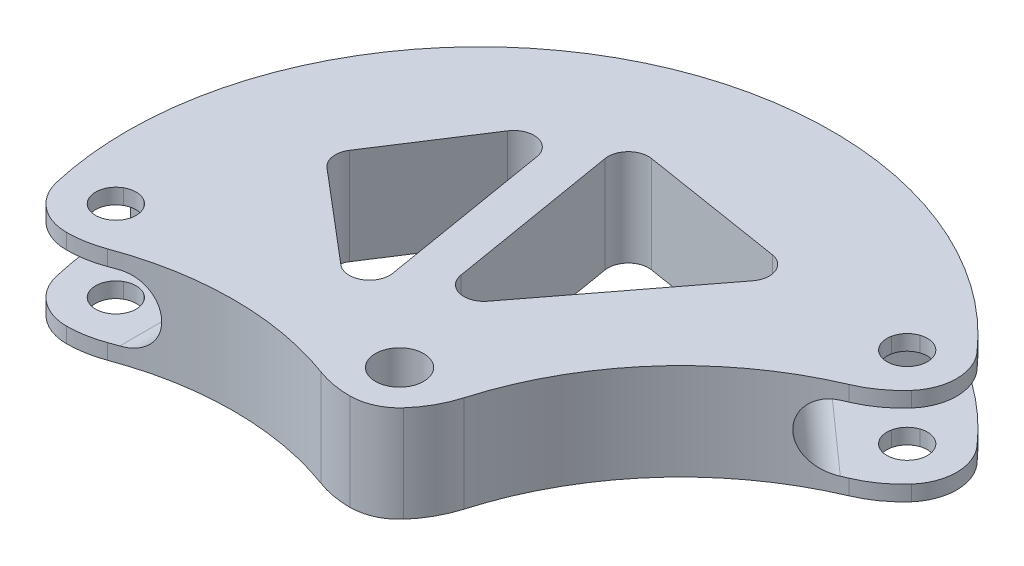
ISO-10303-21;
HEADER;
FILE_DESCRIPTION(('STEP AP214'),'2;1');
FILE_NAME('part.step','',(''),(''),'','','');
FILE_SCHEMA(('AUTOMOTIVE_DESIGN { 1 0 10303 214 1 1 1 1 }'));
ENDSEC;
DATA;
#1=APPLICATION_CONTEXT('core data for automotive mechanical design processes');
#2=APPLICATION_PROTOCOL_DEFINITION('international standard','automotive_design',2000,#1);
#3=PRODUCT_CONTEXT('',#1,'mechanical');
#4=PRODUCT('Part','Part','',(#3));
#5=PRODUCT_RELATED_PRODUCT_CATEGORY('part','',(#4));
#6=PRODUCT_DEFINITION_FORMATION('','',#4);
#7=PRODUCT_DEFINITION_CONTEXT('part definition',#1,'design');
#8=PRODUCT_DEFINITION('design','',#6,#7);
#9=PRODUCT_DEFINITION_SHAPE('','',#8);
#10=(LENGTH_UNIT() NAMED_UNIT(*) SI_UNIT(.MILLI.,.METRE.));
#11=(NAMED_UNIT(*) PLANE_ANGLE_UNIT() SI_UNIT($,.RADIAN.));
#12=(NAMED_UNIT(*) SI_UNIT($,.STERADIAN.) SOLID_ANGLE_UNIT());
#13=UNCERTAINTY_MEASURE_WITH_UNIT(LENGTH_MEASURE(1.E-05),#10,'distance_accuracy_value','');
#14=(GEOMETRIC_REPRESENTATION_CONTEXT(3) GLOBAL_UNCERTAINTY_ASSIGNED_CONTEXT((#13)) GLOBAL_UNIT_ASSIGNED_CONTEXT((#10,
#11,#12)) REPRESENTATION_CONTEXT('',''));
#15=CARTESIAN_POINT('',(0.,0.,0.));
#16=DIRECTION('',(0.,0.,1.));
#17=DIRECTION('',(1.,0.,0.));
#18=AXIS2_PLACEMENT_3D('',#15,#16,#17);
#19=CARTESIAN_POINT('',(51.5669642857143,-9.525,-26.5489772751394));
#20=DIRECTION('',(0.,1.,0.));
#21=DIRECTION('',(0.,0.,1.));
#22=AXIS2_PLACEMENT_3D('',#19,#20,#21);
#23=CYLINDRICAL_SURFACE('',#22,4.00000000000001);
#24=DIRECTION('',(0.,1.,0.));
#25=VECTOR('',#24,1.);
#26=CARTESIAN_POINT('',(47.6485900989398,-9.525,-27.3529323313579));
#27=LINE('',#26,#25);
#28=CARTESIAN_POINT('',(47.6485900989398,-6.5,-27.3529323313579));
#29=VERTEX_POINT('',#28);
#30=CARTESIAN_POINT('',(47.6485900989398,-9.525,-27.3529323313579));
#31=VERTEX_POINT('',#30);
#32=EDGE_CURVE('E688',#29,#31,#27,.F.);
#33=ORIENTED_EDGE('',*,*,#32,.F.);
#34=CARTESIAN_POINT('',(51.5669642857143,-6.5,-26.5489772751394));
#35=DIRECTION('',(0.,-1.,0.));
#36=DIRECTION('',(0.,0.,-1.));
#37=AXIS2_PLACEMENT_3D('',#34,#35,#36);
#38=CIRCLE('',#37,4.00000000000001);
#39=CARTESIAN_POINT('',(52.8299058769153,-6.5,-22.7535881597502));
#40=VERTEX_POINT('',#39);
#41=EDGE_CURVE('E660',#29,#40,#38,.F.);
#42=ORIENTED_EDGE('',*,*,#41,.T.);
#43=DIRECTION('',(0.,1.,0.));
#44=VECTOR('',#43,1.);
#45=CARTESIAN_POINT('',(52.8299058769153,-9.525,-22.7535881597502));
#46=LINE('',#45,#44);
#47=CARTESIAN_POINT('',(52.8299058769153,-9.525,-22.7535881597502));
#48=VERTEX_POINT('',#47);
#49=EDGE_CURVE('E692',#48,#40,#46,.T.);
#50=ORIENTED_EDGE('',*,*,#49,.F.);
#51=CARTESIAN_POINT('',(51.5669642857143,-9.525,-26.5489772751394));
#52=DIRECTION('',(0.,1.,0.));
#53=DIRECTION('',(0.,0.,1.));
#54=AXIS2_PLACEMENT_3D('',#51,#52,#53);
#55=CIRCLE('',#54,4.00000000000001);
#56=EDGE_CURVE('E600',#31,#48,#55,.T.);
#57=ORIENTED_EDGE('',*,*,#56,.F.);
#58=EDGE_LOOP('',(#33,#42,#50,#57));
#59=FACE_BOUND('',#58,.T.);
#60=ADVANCED_FACE('F37',(#59),#23,.F.);
#61=CARTESIAN_POINT('',(50.3040226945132,-6.5,-30.3443663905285));
#62=VERTEX_POINT('',#61);
#63=EDGE_CURVE('E546',#62,#29,#38,.F.);
#64=ORIENTED_EDGE('',*,*,#63,.T.);
#65=ORIENTED_EDGE('',*,*,#32,.T.);
#66=CARTESIAN_POINT('',(50.3040226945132,-9.525,-30.3443663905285));
#67=VERTEX_POINT('',#66);
#68=EDGE_CURVE('E1354',#67,#31,#55,.T.);
#69=ORIENTED_EDGE('',*,*,#68,.F.);
#70=DIRECTION('',(0.,1.,0.));
#71=VECTOR('',#70,1.);
#72=CARTESIAN_POINT('',(50.3040226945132,-9.525,-30.3443663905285));
#73=LINE('',#72,#71);
#74=EDGE_CURVE('E699',#67,#62,#73,.T.);
#75=ORIENTED_EDGE('',*,*,#74,.T.);
#76=EDGE_LOOP('',(#64,#65,#69,#75));
#77=FACE_BOUND('',#76,.T.);
#78=ADVANCED_FACE('F778',(#77),#23,.F.);
#79=DIRECTION('',(0.,1.,0.));
#80=VECTOR('',#79,1.);
#81=CARTESIAN_POINT('',(55.4853384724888,-9.525,-25.7450222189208));
#82=LINE('',#81,#80);
#83=CARTESIAN_POINT('',(55.4853384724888,-6.5,-25.7450222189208));
#84=VERTEX_POINT('',#83);
#85=CARTESIAN_POINT('',(55.4853384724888,-9.525,-25.7450222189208));
#86=VERTEX_POINT('',#85);
#87=EDGE_CURVE('E695',#84,#86,#82,.F.);
#88=ORIENTED_EDGE('',*,*,#87,.F.);
#89=EDGE_CURVE('E541',#84,#62,#38,.F.);
#90=ORIENTED_EDGE('',*,*,#89,.T.);
#91=ORIENTED_EDGE('',*,*,#74,.F.);
#92=EDGE_CURVE('E605',#86,#67,#55,.T.);
#93=ORIENTED_EDGE('',*,*,#92,.F.);
#94=EDGE_LOOP('',(#88,#90,#91,#93));
#95=FACE_BOUND('',#94,.T.);
#96=ADVANCED_FACE('F785',(#95),#23,.F.);
#97=DIRECTION('',(0.,1.,0.));
#98=VECTOR('',#97,1.);
#99=CARTESIAN_POINT('',(47.6485900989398,-9.525,-27.3529323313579));
#100=LINE('',#99,#98);
#101=CARTESIAN_POINT('',(47.6485900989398,9.525,-27.3529323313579));
#102=VERTEX_POINT('',#101);
#103=CARTESIAN_POINT('',(47.6485900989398,6.5,-27.3529323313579));
#104=VERTEX_POINT('',#103);
#105=EDGE_CURVE('E696',#102,#104,#100,.F.);
#106=ORIENTED_EDGE('',*,*,#105,.F.);
#107=CARTESIAN_POINT('',(51.5669642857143,9.525,-26.5489772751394));
#108=DIRECTION('',(0.,1.,0.));
#109=DIRECTION('',(0.,0.,1.));
#110=AXIS2_PLACEMENT_3D('',#107,#108,#109);
#111=CIRCLE('',#110,4.00000000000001);
#112=CARTESIAN_POINT('',(52.8299058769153,9.525,-22.7535881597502));
#113=VERTEX_POINT('',#112);
#114=EDGE_CURVE('E575',#102,#113,#111,.T.);
#115=ORIENTED_EDGE('',*,*,#114,.T.);
#116=DIRECTION('',(0.,1.,0.));
#117=VECTOR('',#116,1.);
#118=CARTESIAN_POINT('',(52.8299058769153,-9.525,-22.7535881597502));
#119=LINE('',#118,#117);
#120=CARTESIAN_POINT('',(52.8299058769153,6.5,-22.7535881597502));
#121=VERTEX_POINT('',#120);
#122=EDGE_CURVE('E700',#121,#113,#119,.T.);
#123=ORIENTED_EDGE('',*,*,#122,.F.);
#124=CARTESIAN_POINT('',(51.5669642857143,6.5,-26.5489772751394));
#125=DIRECTION('',(0.,1.,0.));
#126=DIRECTION('',(0.,0.,1.));
#127=AXIS2_PLACEMENT_3D('',#124,#125,#126);
#128=CIRCLE('',#127,4.00000000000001);
#129=EDGE_CURVE('E532',#121,#104,#128,.F.);
#130=ORIENTED_EDGE('',*,*,#129,.T.);
#131=EDGE_LOOP('',(#106,#115,#123,#130));
#132=FACE_BOUND('',#131,.T.);
#133=ADVANCED_FACE('F830',(#132),#23,.F.);
#134=CARTESIAN_POINT('',(50.3040226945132,9.525,-30.3443663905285));
#135=VERTEX_POINT('',#134);
#136=EDGE_CURVE('E842',#135,#102,#111,.T.);
#137=ORIENTED_EDGE('',*,*,#136,.T.);
#138=ORIENTED_EDGE('',*,*,#105,.T.);
#139=CARTESIAN_POINT('',(50.3040226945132,6.5,-30.3443663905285));
#140=VERTEX_POINT('',#139);
#141=EDGE_CURVE('E539',#104,#140,#128,.F.);
#142=ORIENTED_EDGE('',*,*,#141,.T.);
#143=DIRECTION('',(0.,1.,0.));
#144=VECTOR('',#143,1.);
#145=CARTESIAN_POINT('',(50.3040226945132,-9.525,-30.3443663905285));
#146=LINE('',#145,#144);
#147=EDGE_CURVE('E667',#140,#135,#146,.T.);
#148=ORIENTED_EDGE('',*,*,#147,.T.);
#149=EDGE_LOOP('',(#137,#138,#142,#148));
#150=FACE_BOUND('',#149,.T.);
#151=ADVANCED_FACE('F821',(#150),#23,.F.);
#152=DIRECTION('',(0.,1.,0.));
#153=VECTOR('',#152,1.);
#154=CARTESIAN_POINT('',(55.4853384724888,-9.525,-25.7450222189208));
#155=LINE('',#154,#153);
#156=CARTESIAN_POINT('',(55.4853384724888,9.525,-25.7450222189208));
#157=VERTEX_POINT('',#156);
#158=CARTESIAN_POINT('',(55.4853384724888,6.5,-25.7450222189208));
#159=VERTEX_POINT('',#158);
#160=EDGE_CURVE('E703',#157,#159,#155,.F.);
#161=ORIENTED_EDGE('',*,*,#160,.F.);
#162=EDGE_CURVE('E580',#157,#135,#111,.T.);
#163=ORIENTED_EDGE('',*,*,#162,.T.);
#164=ORIENTED_EDGE('',*,*,#147,.F.);
#165=EDGE_CURVE('E657',#140,#159,#128,.F.);
#166=ORIENTED_EDGE('',*,*,#165,.T.);
#167=EDGE_LOOP('',(#161,#163,#164,#166));
#168=FACE_BOUND('',#167,.T.);
#169=ADVANCED_FACE('F807',(#168),#23,.F.);
#170=CARTESIAN_POINT('',(-51.5669642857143,-9.525,26.5489772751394));
#171=DIRECTION('',(0.,1.,0.));
#172=DIRECTION('',(0.,0.,1.));
#173=AXIS2_PLACEMENT_3D('',#170,#171,#172);
#174=CYLINDRICAL_SURFACE('',#173,4.00000000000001);
#175=DIRECTION('',(0.,1.,0.));
#176=VECTOR('',#175,1.);
#177=CARTESIAN_POINT('',(-49.5669642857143,-9.525,30.0130788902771));
#178=LINE('',#177,#176);
#179=CARTESIAN_POINT('',(-49.5669642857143,-6.5,30.0130788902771));
#180=VERTEX_POINT('',#179);
#181=CARTESIAN_POINT('',(-49.5669642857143,-9.525,30.0130788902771));
#182=VERTEX_POINT('',#181);
#183=EDGE_CURVE('E664',#180,#182,#178,.F.);
#184=ORIENTED_EDGE('',*,*,#183,.F.);
#185=CARTESIAN_POINT('',(-51.5669642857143,-6.5,26.5489772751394));
#186=DIRECTION('',(0.,-1.,0.));
#187=DIRECTION('',(1.,0.,0.));
#188=AXIS2_PLACEMENT_3D('',#185,#186,#187);
#189=CIRCLE('',#188,4.00000000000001);
#190=CARTESIAN_POINT('',(-49.5669642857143,-6.5,23.0848756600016));
#191=VERTEX_POINT('',#190);
#192=EDGE_CURVE('E560',#180,#191,#189,.F.);
#193=ORIENTED_EDGE('',*,*,#192,.T.);
#194=DIRECTION('',(0.,1.,0.));
#195=VECTOR('',#194,1.);
#196=CARTESIAN_POINT('',(-49.5669642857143,-9.525,23.0848756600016));
#197=LINE('',#196,#195);
#198=CARTESIAN_POINT('',(-49.5669642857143,-9.525,23.0848756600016));
#199=VERTEX_POINT('',#198);
#200=EDGE_CURVE('E668',#199,#191,#197,.T.);
#201=ORIENTED_EDGE('',*,*,#200,.F.);
#202=CARTESIAN_POINT('',(-51.5669642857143,-9.525,26.5489772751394));
#203=DIRECTION('',(0.,1.,0.));
#204=DIRECTION('',(0.,0.,1.));
#205=AXIS2_PLACEMENT_3D('',#202,#203,#204);
#206=CIRCLE('',#205,4.00000000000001);
#207=EDGE_CURVE('E609',#182,#199,#206,.T.);
#208=ORIENTED_EDGE('',*,*,#207,.F.);
#209=EDGE_LOOP('',(#184,#193,#201,#208));
#210=FACE_BOUND('',#209,.T.);
#211=ADVANCED_FACE('F820',(#210),#174,.F.);
#212=CARTESIAN_POINT('',(-53.5669642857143,-6.5,30.0130788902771));
#213=VERTEX_POINT('',#212);
#214=EDGE_CURVE('E1325',#213,#180,#189,.F.);
#215=ORIENTED_EDGE('',*,*,#214,.T.);
#216=ORIENTED_EDGE('',*,*,#183,.T.);
#217=CARTESIAN_POINT('',(-53.5669642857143,-9.525,30.0130788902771));
#218=VERTEX_POINT('',#217);
#219=EDGE_CURVE('E608',#218,#182,#206,.T.);
#220=ORIENTED_EDGE('',*,*,#219,.F.);
#221=DIRECTION('',(0.,1.,0.));
#222=VECTOR('',#221,1.);
#223=CARTESIAN_POINT('',(-53.5669642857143,-9.525,30.0130788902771));
#224=LINE('',#223,#222);
#225=EDGE_CURVE('E675',#218,#213,#224,.T.);
#226=ORIENTED_EDGE('',*,*,#225,.T.);
#227=EDGE_LOOP('',(#215,#216,#220,#226));
#228=FACE_BOUND('',#227,.T.);
#229=ADVANCED_FACE('F827',(#228),#174,.F.);
#230=DIRECTION('',(0.,1.,0.));
#231=VECTOR('',#230,1.);
#232=CARTESIAN_POINT('',(-53.5669642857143,-9.525,23.0848756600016));
#233=LINE('',#232,#231);
#234=CARTESIAN_POINT('',(-53.5669642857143,-6.5,23.0848756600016));
#235=VERTEX_POINT('',#234);
#236=CARTESIAN_POINT('',(-53.5669642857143,-9.525,23.0848756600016));
#237=VERTEX_POINT('',#236);
#238=EDGE_CURVE('E671',#235,#237,#233,.F.);
#239=ORIENTED_EDGE('',*,*,#238,.F.);
#240=EDGE_CURVE('E648',#235,#213,#189,.F.);
#241=ORIENTED_EDGE('',*,*,#240,.T.);
#242=ORIENTED_EDGE('',*,*,#225,.F.);
#243=EDGE_CURVE('E1339',#237,#218,#206,.T.);
#244=ORIENTED_EDGE('',*,*,#243,.F.);
#245=EDGE_LOOP('',(#239,#241,#242,#244));
#246=FACE_BOUND('',#245,.T.);
#247=ADVANCED_FACE('F1256',(#246),#174,.F.);
#248=DIRECTION('',(0.,1.,0.));
#249=VECTOR('',#248,1.);
#250=CARTESIAN_POINT('',(-49.5669642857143,-9.525,30.0130788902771));
#251=LINE('',#250,#249);
#252=CARTESIAN_POINT('',(-49.5669642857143,9.525,30.0130788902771));
#253=VERTEX_POINT('',#252);
#254=CARTESIAN_POINT('',(-49.5669642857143,6.5,30.0130788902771));
#255=VERTEX_POINT('',#254);
#256=EDGE_CURVE('E672',#253,#255,#251,.F.);
#257=ORIENTED_EDGE('',*,*,#256,.F.);
#258=CARTESIAN_POINT('',(-51.5669642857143,9.525,26.5489772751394));
#259=DIRECTION('',(0.,1.,0.));
#260=DIRECTION('',(0.,0.,1.));
#261=AXIS2_PLACEMENT_3D('',#258,#259,#260);
#262=CIRCLE('',#261,4.00000000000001);
#263=CARTESIAN_POINT('',(-49.5669642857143,9.525,23.0848756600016));
#264=VERTEX_POINT('',#263);
#265=EDGE_CURVE('E584',#253,#264,#262,.T.);
#266=ORIENTED_EDGE('',*,*,#265,.T.);
#267=DIRECTION('',(0.,1.,0.));
#268=VECTOR('',#267,1.);
#269=CARTESIAN_POINT('',(-49.5669642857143,-9.525,23.0848756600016));
#270=LINE('',#269,#268);
#271=CARTESIAN_POINT('',(-49.5669642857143,6.5,23.0848756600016));
#272=VERTEX_POINT('',#271);
#273=EDGE_CURVE('E676',#272,#264,#270,.T.);
#274=ORIENTED_EDGE('',*,*,#273,.F.);
#275=CARTESIAN_POINT('',(-51.5669642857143,6.5,26.5489772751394));
#276=DIRECTION('',(0.,1.,0.));
#277=DIRECTION('',(-1.,0.,0.));
#278=AXIS2_PLACEMENT_3D('',#275,#276,#277);
#279=CIRCLE('',#278,4.00000000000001);
#280=EDGE_CURVE('E651',#272,#255,#279,.F.);
#281=ORIENTED_EDGE('',*,*,#280,.T.);
#282=EDGE_LOOP('',(#257,#266,#274,#281));
#283=FACE_BOUND('',#282,.T.);
#284=ADVANCED_FACE('F1104',(#283),#174,.F.);
#285=CARTESIAN_POINT('',(-53.5669642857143,9.525,30.0130788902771));
#286=VERTEX_POINT('',#285);
#287=EDGE_CURVE('E583',#286,#253,#262,.T.);
#288=ORIENTED_EDGE('',*,*,#287,.T.);
#289=ORIENTED_EDGE('',*,*,#256,.T.);
#290=CARTESIAN_POINT('',(-53.5669642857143,6.5,30.0130788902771));
#291=VERTEX_POINT('',#290);
#292=EDGE_CURVE('E1123',#255,#291,#279,.F.);
#293=ORIENTED_EDGE('',*,*,#292,.T.);
#294=DIRECTION('',(0.,1.,0.));
#295=VECTOR('',#294,1.);
#296=CARTESIAN_POINT('',(-53.5669642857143,-9.525,30.0130788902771));
#297=LINE('',#296,#295);
#298=EDGE_CURVE('E663',#291,#286,#297,.T.);
#299=ORIENTED_EDGE('',*,*,#298,.T.);
#300=EDGE_LOOP('',(#288,#289,#293,#299));
#301=FACE_BOUND('',#300,.T.);
#302=ADVANCED_FACE('F1099',(#301),#174,.F.);
#303=DIRECTION('',(0.,1.,0.));
#304=VECTOR('',#303,1.);
#305=CARTESIAN_POINT('',(-53.5669642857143,-9.525,23.0848756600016));
#306=LINE('',#305,#304);
#307=CARTESIAN_POINT('',(-53.5669642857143,9.525,23.0848756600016));
#308=VERTEX_POINT('',#307);
#309=CARTESIAN_POINT('',(-53.5669642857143,6.5,23.0848756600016));
#310=VERTEX_POINT('',#309);
#311=EDGE_CURVE('E679',#308,#310,#306,.F.);
#312=ORIENTED_EDGE('',*,*,#311,.F.);
#313=EDGE_CURVE('E1109',#308,#286,#262,.T.);
#314=ORIENTED_EDGE('',*,*,#313,.T.);
#315=ORIENTED_EDGE('',*,*,#298,.F.);
#316=EDGE_CURVE('E569',#291,#310,#279,.F.);
#317=ORIENTED_EDGE('',*,*,#316,.T.);
#318=EDGE_LOOP('',(#312,#314,#315,#317));
#319=FACE_BOUND('',#318,.T.);
#320=ADVANCED_FACE('F814',(#319),#174,.F.);
#321=CARTESIAN_POINT('',(51.5669642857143,-9.525,-26.5489772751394));
#322=DIRECTION('',(0.,1.,0.));
#323=DIRECTION('',(0.,0.,1.));
#324=AXIS2_PLACEMENT_3D('',#321,#322,#323);
#325=CYLINDRICAL_SURFACE('',#324,9.76500000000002);
#326=CARTESIAN_POINT('',(51.5669642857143,-6.5,-26.5489772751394));
#327=DIRECTION('',(0.,-1.,0.));
#328=DIRECTION('',(0.,0.,-1.));
#329=AXIS2_PLACEMENT_3D('',#326,#327,#328);
#330=CIRCLE('',#329,9.76500000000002);
#331=CARTESIAN_POINT('',(58.8698026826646,-6.5,-20.0664024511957));
#332=VERTEX_POINT('',#331);
#333=CARTESIAN_POINT('',(58.8912111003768,-6.5,-33.0073542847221));
#334=VERTEX_POINT('',#333);
#335=EDGE_CURVE('E542',#332,#334,#330,.F.);
#336=ORIENTED_EDGE('',*,*,#335,.F.);
#337=DIRECTION('',(0.,1.,0.));
#338=VECTOR('',#337,1.);
#339=CARTESIAN_POINT('',(58.8698026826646,-9.525,-20.0664024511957));
#340=LINE('',#339,#338);
#341=CARTESIAN_POINT('',(58.8698026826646,-9.525,-20.0664024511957));
#342=VERTEX_POINT('',#341);
#343=EDGE_CURVE('E635',#342,#332,#340,.T.);
#344=ORIENTED_EDGE('',*,*,#343,.F.);
#345=CARTESIAN_POINT('',(51.5669642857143,-9.525,-26.5489772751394));
#346=DIRECTION('',(0.,1.,0.));
#347=DIRECTION('',(0.,0.,1.));
#348=AXIS2_PLACEMENT_3D('',#345,#346,#347);
#349=CIRCLE('',#348,9.76500000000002);
#350=CARTESIAN_POINT('',(58.8912111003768,-9.525,-33.0073542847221));
#351=VERTEX_POINT('',#350);
#352=EDGE_CURVE('E619',#342,#351,#349,.T.);
#353=ORIENTED_EDGE('',*,*,#352,.T.);
#354=DIRECTION('',(0.,1.,0.));
#355=VECTOR('',#354,1.);
#356=CARTESIAN_POINT('',(58.8912111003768,-9.525,-33.0073542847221));
#357=LINE('',#356,#355);
#358=EDGE_CURVE('E631',#351,#334,#357,.T.);
#359=ORIENTED_EDGE('',*,*,#358,.T.);
#360=EDGE_LOOP('',(#336,#344,#353,#359));
#361=FACE_BOUND('',#360,.T.);
#362=ADVANCED_FACE('F805',(#361),#325,.T.);
#363=EDGE_CURVE('E601',#48,#86,#55,.T.);
#364=ORIENTED_EDGE('',*,*,#363,.F.);
#365=ORIENTED_EDGE('',*,*,#49,.T.);
#366=EDGE_CURVE('E1348',#40,#84,#38,.F.);
#367=ORIENTED_EDGE('',*,*,#366,.T.);
#368=ORIENTED_EDGE('',*,*,#87,.T.);
#369=EDGE_LOOP('',(#364,#365,#367,#368));
#370=FACE_BOUND('',#369,.T.);
#371=ADVANCED_FACE('F793',(#370),#23,.F.);
#372=CARTESIAN_POINT('',(-51.5669642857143,-9.525,26.5489772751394));
#373=DIRECTION('',(0.,1.,0.));
#374=DIRECTION('',(0.,0.,1.));
#375=AXIS2_PLACEMENT_3D('',#372,#373,#374);
#376=CYLINDRICAL_SURFACE('',#375,9.76500000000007);
#377=CARTESIAN_POINT('',(-51.5669642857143,6.5,26.5489772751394));
#378=DIRECTION('',(0.,1.,0.));
#379=DIRECTION('',(-1.,0.,0.));
#380=AXIS2_PLACEMENT_3D('',#377,#378,#379);
#381=CIRCLE('',#380,9.76500000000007);
#382=CARTESIAN_POINT('',(-51.5669642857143,6.5,36.3139772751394));
#383=VERTEX_POINT('',#382);
#384=CARTESIAN_POINT('',(-61.0787021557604,6.5,28.7585174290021));
#385=VERTEX_POINT('',#384);
#386=EDGE_CURVE('E572',#383,#385,#381,.F.);
#387=ORIENTED_EDGE('',*,*,#386,.F.);
#388=DIRECTION('',(0.,1.,0.));
#389=VECTOR('',#388,1.);
#390=CARTESIAN_POINT('',(-51.5669642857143,-9.525,36.3139772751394));
#391=LINE('',#390,#389);
#392=CARTESIAN_POINT('',(-51.5669642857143,9.525,36.3139772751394));
#393=VERTEX_POINT('',#392);
#394=EDGE_CURVE('E625',#383,#393,#391,.T.);
#395=ORIENTED_EDGE('',*,*,#394,.T.);
#396=CARTESIAN_POINT('',(-51.5669642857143,9.525,26.5489772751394));
#397=DIRECTION('',(0.,1.,0.));
#398=DIRECTION('',(0.,0.,1.));
#399=AXIS2_PLACEMENT_3D('',#396,#397,#398);
#400=CIRCLE('',#399,9.76500000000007);
#401=CARTESIAN_POINT('',(-61.0787021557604,9.525,28.7585174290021));
#402=VERTEX_POINT('',#401);
#403=EDGE_CURVE('E587',#402,#393,#400,.T.);
#404=ORIENTED_EDGE('',*,*,#403,.F.);
#405=DIRECTION('',(0.,1.,0.));
#406=VECTOR('',#405,1.);
#407=CARTESIAN_POINT('',(-61.0787021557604,-9.525,28.7585174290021));
#408=LINE('',#407,#406);
#409=EDGE_CURVE('E630',#385,#402,#408,.T.);
#410=ORIENTED_EDGE('',*,*,#409,.F.);
#411=EDGE_LOOP('',(#387,#395,#404,#410));
#412=FACE_BOUND('',#411,.T.);
#413=ADVANCED_FACE('F804',(#412),#376,.T.);
#414=CARTESIAN_POINT('',(6.70006983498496,-9.525,13.0137691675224));
#415=DIRECTION('',(0.,1.,0.));
#416=DIRECTION('',(0.,0.,1.));
#417=AXIS2_PLACEMENT_3D('',#414,#415,#416);
#418=CYLINDRICAL_SURFACE('',#417,69.5834680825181);
#419=CARTESIAN_POINT('',(58.8912111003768,6.50000000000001,-33.0073542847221));
#420=VERTEX_POINT('',#419);
#421=CARTESIAN_POINT('',(58.8912111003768,9.525,-33.0073542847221));
#422=VERTEX_POINT('',#421);
#423=EDGE_CURVE('E634',#420,#422,#357,.T.);
#424=ORIENTED_EDGE('',*,*,#423,.F.);
#425=CARTESIAN_POINT('',(6.70006983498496,6.49999999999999,13.0137691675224));
#426=DIRECTION('',(0.,1.,0.));
#427=DIRECTION('',(0.,0.,1.));
#428=AXIS2_PLACEMENT_3D('',#425,#426,#427);
#429=CIRCLE('',#428,69.5834680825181);
#430=CARTESIAN_POINT('',(47.4691168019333,6.5,-43.3754482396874));
#431=VERTEX_POINT('',#430);
#432=EDGE_CURVE('E538',#431,#420,#429,.F.);
#433=ORIENTED_EDGE('',*,*,#432,.F.);
#434=DIRECTION('',(0.,1.,0.));
#435=VECTOR('',#434,1.);
#436=CARTESIAN_POINT('',(47.4691168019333,-9.525,-43.3754482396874));
#437=LINE('',#436,#435);
#438=CARTESIAN_POINT('',(47.4691168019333,-6.5,-43.3754482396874));
#439=VERTEX_POINT('',#438);
#440=EDGE_CURVE('E654',#431,#439,#437,.F.);
#441=ORIENTED_EDGE('',*,*,#440,.T.);
#442=CARTESIAN_POINT('',(6.70006983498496,-6.5,13.0137691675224));
#443=DIRECTION('',(0.,-1.,0.));
#444=DIRECTION('',(0.,0.,-1.));
#445=AXIS2_PLACEMENT_3D('',#442,#443,#444);
#446=CIRCLE('',#445,69.5834680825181);
#447=EDGE_CURVE('E545',#334,#439,#446,.F.);
#448=ORIENTED_EDGE('',*,*,#447,.F.);
#449=ORIENTED_EDGE('',*,*,#358,.F.);
#450=CARTESIAN_POINT('',(6.70006983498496,-9.525,13.0137691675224));
#451=DIRECTION('',(0.,1.,0.));
#452=DIRECTION('',(0.,0.,1.));
#453=AXIS2_PLACEMENT_3D('',#450,#451,#452);
#454=CIRCLE('',#453,69.5834680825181);
#455=CARTESIAN_POINT('',(-61.0787021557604,-9.525,28.7585174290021));
#456=VERTEX_POINT('',#455);
#457=EDGE_CURVE('E622',#351,#456,#454,.T.);
#458=ORIENTED_EDGE('',*,*,#457,.T.);
#459=CARTESIAN_POINT('',(-61.0787021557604,-6.5,28.7585174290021));
#460=VERTEX_POINT('',#459);
#461=EDGE_CURVE('E626',#456,#460,#408,.T.);
#462=ORIENTED_EDGE('',*,*,#461,.T.);
#463=CARTESIAN_POINT('',(6.70006983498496,-6.49999999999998,13.0137691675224));
#464=DIRECTION('',(0.,-1.,0.));
#465=DIRECTION('',(1.,0.,0.));
#466=AXIS2_PLACEMENT_3D('',#463,#464,#465);
#467=CIRCLE('',#466,69.5834680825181);
#468=CARTESIAN_POINT('',(-62.8798793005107,-6.5,12.3139772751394));
#469=VERTEX_POINT('',#468);
#470=EDGE_CURVE('E563',#469,#460,#467,.F.);
#471=ORIENTED_EDGE('',*,*,#470,.F.);
#472=DIRECTION('',(0.,1.,0.));
#473=VECTOR('',#472,1.);
#474=CARTESIAN_POINT('',(-62.8798793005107,-9.525,12.3139772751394));
#475=LINE('',#474,#473);
#476=CARTESIAN_POINT('',(-62.8798793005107,6.5,12.3139772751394));
#477=VERTEX_POINT('',#476);
#478=EDGE_CURVE('E629',#477,#469,#475,.F.);
#479=ORIENTED_EDGE('',*,*,#478,.F.);
#480=CARTESIAN_POINT('',(6.70006983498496,6.50000000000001,13.0137691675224));
#481=DIRECTION('',(0.,1.,0.));
#482=DIRECTION('',(-1.,0.,0.));
#483=AXIS2_PLACEMENT_3D('',#480,#481,#482);
#484=CIRCLE('',#483,69.5834680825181);
#485=EDGE_CURVE('E570',#385,#477,#484,.F.);
#486=ORIENTED_EDGE('',*,*,#485,.F.);
#487=ORIENTED_EDGE('',*,*,#409,.T.);
#488=CARTESIAN_POINT('',(6.70006983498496,9.525,13.0137691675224));
#489=DIRECTION('',(0.,1.,0.));
#490=DIRECTION('',(0.,0.,1.));
#491=AXIS2_PLACEMENT_3D('',#488,#489,#490);
#492=CIRCLE('',#491,69.5834680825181);
#493=EDGE_CURVE('E597',#422,#402,#492,.T.);
#494=ORIENTED_EDGE('',*,*,#493,.F.);
#495=EDGE_LOOP('',(#424,#433,#441,#448,#449,#458,#462,#471,#479,#486,#487,#494));
#496=FACE_BOUND('',#495,.T.);
#497=ADVANCED_FACE('F812',(#496),#418,.T.);
#498=EDGE_CURVE('E573',#310,#272,#279,.F.);
#499=ORIENTED_EDGE('',*,*,#498,.T.);
#500=ORIENTED_EDGE('',*,*,#273,.T.);
#501=EDGE_CURVE('E588',#264,#308,#262,.T.);
#502=ORIENTED_EDGE('',*,*,#501,.T.);
#503=ORIENTED_EDGE('',*,*,#311,.T.);
#504=EDGE_LOOP('',(#499,#500,#502,#503));
#505=FACE_BOUND('',#504,.T.);
#506=ADVANCED_FACE('F1085',(#505),#174,.F.);
#507=CARTESIAN_POINT('',(-51.5669642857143,-6.5,26.5489772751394));
#508=DIRECTION('',(0.,-1.,0.));
#509=DIRECTION('',(1.,0.,0.));
#510=AXIS2_PLACEMENT_3D('',#507,#508,#509);
#511=CIRCLE('',#510,9.76500000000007);
#512=CARTESIAN_POINT('',(-51.5669642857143,-6.5,36.3139772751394));
#513=VERTEX_POINT('',#512);
#514=EDGE_CURVE('E565',#460,#513,#511,.F.);
#515=ORIENTED_EDGE('',*,*,#514,.F.);
#516=ORIENTED_EDGE('',*,*,#461,.F.);
#517=CARTESIAN_POINT('',(-51.5669642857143,-9.525,26.5489772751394));
#518=DIRECTION('',(0.,1.,0.));
#519=DIRECTION('',(0.,0.,1.));
#520=AXIS2_PLACEMENT_3D('',#517,#518,#519);
#521=CIRCLE('',#520,9.76500000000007);
#522=CARTESIAN_POINT('',(-51.5669642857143,-9.525,36.3139772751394));
#523=VERTEX_POINT('',#522);
#524=EDGE_CURVE('E612',#456,#523,#521,.T.);
#525=ORIENTED_EDGE('',*,*,#524,.T.);
#526=EDGE_CURVE('E643',#523,#513,#391,.T.);
#527=ORIENTED_EDGE('',*,*,#526,.T.);
#528=EDGE_LOOP('',(#515,#516,#525,#527));
#529=FACE_BOUND('',#528,.T.);
#530=ADVANCED_FACE('F39',(#529),#376,.T.);
#531=CARTESIAN_POINT('',(51.5669642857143,6.5,-26.5489772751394));
#532=DIRECTION('',(0.,1.,0.));
#533=DIRECTION('',(0.,0.,1.));
#534=AXIS2_PLACEMENT_3D('',#531,#532,#533);
#535=CIRCLE('',#534,9.76500000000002);
#536=CARTESIAN_POINT('',(58.8698026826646,6.49999999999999,-20.0664024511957));
#537=VERTEX_POINT('',#536);
#538=EDGE_CURVE('E535',#420,#537,#535,.F.);
#539=ORIENTED_EDGE('',*,*,#538,.F.);
#540=ORIENTED_EDGE('',*,*,#423,.T.);
#541=CARTESIAN_POINT('',(51.5669642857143,9.525,-26.5489772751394));
#542=DIRECTION('',(0.,1.,0.));
#543=DIRECTION('',(0.,0.,1.));
#544=AXIS2_PLACEMENT_3D('',#541,#542,#543);
#545=CIRCLE('',#544,9.76500000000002);
#546=CARTESIAN_POINT('',(58.8698026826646,9.525,-20.0664024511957));
#547=VERTEX_POINT('',#546);
#548=EDGE_CURVE('E594',#547,#422,#545,.T.);
#549=ORIENTED_EDGE('',*,*,#548,.F.);
#550=EDGE_CURVE('E637',#537,#547,#340,.T.);
#551=ORIENTED_EDGE('',*,*,#550,.F.);
#552=EDGE_LOOP('',(#539,#540,#549,#551));
#553=FACE_BOUND('',#552,.T.);
#554=ADVANCED_FACE('F817',(#553),#325,.T.);
#555=CARTESIAN_POINT('',(4.43303571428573,-9.525,26.5489772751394));
#556=DIRECTION('',(0.,1.,0.));
#557=DIRECTION('',(0.,0.,1.));
#558=AXIS2_PLACEMENT_3D('',#555,#556,#557);
#559=CYLINDRICAL_SURFACE('',#558,9.765);
#560=DIRECTION('',(0.,1.,0.));
#561=VECTOR('',#560,1.);
#562=CARTESIAN_POINT('',(11.735874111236,-9.525,33.0315520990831));
#563=LINE('',#562,#561);
#564=CARTESIAN_POINT('',(11.735874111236,-9.525,33.0315520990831));
#565=VERTEX_POINT('',#564);
#566=CARTESIAN_POINT('',(11.735874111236,9.525,33.0315520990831));
#567=VERTEX_POINT('',#566);
#568=EDGE_CURVE('E638',#565,#567,#563,.T.);
#569=ORIENTED_EDGE('',*,*,#568,.T.);
#570=CARTESIAN_POINT('',(4.43303571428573,9.525,26.5489772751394));
#571=DIRECTION('',(0.,1.,0.));
#572=DIRECTION('',(0.,0.,1.));
#573=AXIS2_PLACEMENT_3D('',#570,#571,#572);
#574=CIRCLE('',#573,9.765);
#575=CARTESIAN_POINT('',(4.43303571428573,9.525,36.3139772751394));
#576=VERTEX_POINT('',#575);
#577=EDGE_CURVE('E591',#576,#567,#574,.T.);
#578=ORIENTED_EDGE('',*,*,#577,.F.);
#579=DIRECTION('',(0.,1.,0.));
#580=VECTOR('',#579,1.);
#581=CARTESIAN_POINT('',(4.43303571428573,-9.525,36.3139772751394));
#582=LINE('',#581,#580);
#583=CARTESIAN_POINT('',(4.43303571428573,-9.525,36.3139772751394));
#584=VERTEX_POINT('',#583);
#585=EDGE_CURVE('E641',#584,#576,#582,.T.);
#586=ORIENTED_EDGE('',*,*,#585,.F.);
#587=CARTESIAN_POINT('',(4.43303571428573,-9.525,26.5489772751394));
#588=DIRECTION('',(0.,1.,0.));
#589=DIRECTION('',(0.,0.,1.));
#590=AXIS2_PLACEMENT_3D('',#587,#588,#589);
#591=CIRCLE('',#590,9.765);
#592=EDGE_CURVE('E616',#584,#565,#591,.T.);
#593=ORIENTED_EDGE('',*,*,#592,.T.);
#594=EDGE_LOOP('',(#569,#578,#586,#593));
#595=FACE_BOUND('',#594,.T.);
#596=ADVANCED_FACE('F887',(#595),#559,.T.);
#597=CARTESIAN_POINT('',(-51.5669642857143,-9.525,26.5489772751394));
#598=DIRECTION('',(0.,1.,0.));
#599=DIRECTION('',(0.,0.,1.));
#600=AXIS2_PLACEMENT_3D('',#597,#598,#599);
#601=PLANE('',#600);
#602=DIRECTION('',(-0.987507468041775,0.,-0.157572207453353));
#603=VECTOR('',#602,1.);
#604=CARTESIAN_POINT('',(21.9431195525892,-9.525,-29.5335681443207));
#605=LINE('',#604,#603);
#606=CARTESIAN_POINT('',(21.9431195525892,-9.525,-29.5335681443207));
#607=VERTEX_POINT('',#606);
#608=CARTESIAN_POINT('',(-6.42506124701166,-9.525,-34.0601535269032));
#609=VERTEX_POINT('',#608);
#610=EDGE_CURVE('E426',#607,#609,#605,.T.);
#611=ORIENTED_EDGE('',*,*,#610,.T.);
#612=CARTESIAN_POINT('',(-7.05535007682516,-9.525,-30.1101236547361));
#613=DIRECTION('',(0.,1.,0.));
#614=DIRECTION('',(0.,0.,1.));
#615=AXIS2_PLACEMENT_3D('',#612,#613,#614);
#616=CIRCLE('',#615,4.00000000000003);
#617=CARTESIAN_POINT('',(-11.00072783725,-9.525,-29.4513411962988));
#618=VERTEX_POINT('',#617);
#619=EDGE_CURVE('E412',#609,#618,#616,.T.);
#620=ORIENTED_EDGE('',*,*,#619,.T.);
#621=DIRECTION('',(0.164695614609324,0.,0.986344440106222));
#622=VECTOR('',#621,1.);
#623=CARTESIAN_POINT('',(-11.00072783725,-9.525,-29.4513411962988));
#624=LINE('',#623,#622);
#625=CARTESIAN_POINT('',(-5.2937348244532,-9.525,4.72723023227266));
#626=VERTEX_POINT('',#625);
#627=EDGE_CURVE('E415',#618,#626,#624,.T.);
#628=ORIENTED_EDGE('',*,*,#627,.T.);
#629=CARTESIAN_POINT('',(-1.3483570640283,-9.525,4.06844777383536));
#630=DIRECTION('',(0.,1.,0.));
#631=DIRECTION('',(0.,0.,1.));
#632=AXIS2_PLACEMENT_3D('',#629,#630,#631);
#633=CIRCLE('',#632,4.00000000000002);
#634=CARTESIAN_POINT('',(1.82979096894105,-9.525,6.49731069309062));
#635=VERTEX_POINT('',#634);
#636=EDGE_CURVE('E52',#626,#635,#633,.T.);
#637=ORIENTED_EDGE('',*,*,#636,.T.);
#638=DIRECTION('',(0.607215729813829,0.,-0.794537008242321));
#639=VECTOR('',#638,1.);
#640=CARTESIAN_POINT('',(1.82979096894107,-9.525,6.49731069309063));
#641=LINE('',#640,#639);
#642=CARTESIAN_POINT('',(24.490978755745,-9.525,-23.1546753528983));
#643=VERTEX_POINT('',#642);
#644=EDGE_CURVE('E420',#635,#643,#641,.T.);
#645=ORIENTED_EDGE('',*,*,#644,.T.);
#646=CARTESIAN_POINT('',(21.3128307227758,-9.525,-25.5835382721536));
#647=DIRECTION('',(0.,1.,0.));
#648=DIRECTION('',(0.,0.,1.));
#649=AXIS2_PLACEMENT_3D('',#646,#647,#648);
#650=CIRCLE('',#649,4.);
#651=EDGE_CURVE('E423',#643,#607,#650,.T.);
#652=ORIENTED_EDGE('',*,*,#651,.T.);
#653=EDGE_LOOP('',(#611,#620,#628,#637,#645,#652));
#654=FACE_BOUND('',#653,.T.);
#655=DIRECTION('',(-0.164695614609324,0.,-0.986344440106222));
#656=VECTOR('',#655,1.);
#657=CARTESIAN_POINT('',(-18.0473692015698,-9.525,-23.0784667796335));
#658=LINE('',#657,#656);
#659=CARTESIAN_POINT('',(-12.3403761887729,-9.525,11.1001046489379));
#660=VERTEX_POINT('',#659);
#661=CARTESIAN_POINT('',(-18.0473692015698,-9.525,-23.0784667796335));
#662=VERTEX_POINT('',#661);
#663=EDGE_CURVE('E366',#660,#662,#658,.T.);
#664=ORIENTED_EDGE('',*,*,#663,.T.);
#665=CARTESIAN_POINT('',(-21.9927469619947,-9.525,-22.4196843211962));
#666=DIRECTION('',(0.,1.,0.));
#667=DIRECTION('',(0.,0.,1.));
#668=AXIS2_PLACEMENT_3D('',#665,#666,#667);
#669=CIRCLE('',#668,4.);
#670=CARTESIAN_POINT('',(-25.3488762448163,-9.525,-24.5960106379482));
#671=VERTEX_POINT('',#670);
#672=EDGE_CURVE('E358',#662,#671,#669,.T.);
#673=ORIENTED_EDGE('',*,*,#672,.T.);
#674=DIRECTION('',(-0.544081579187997,0.,0.839032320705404));
#675=VECTOR('',#674,1.);
#676=CARTESIAN_POINT('',(-25.3488762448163,-9.525,-24.5960106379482));
#677=LINE('',#676,#675);
#678=CARTESIAN_POINT('',(-37.6322017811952,-9.525,-5.65380137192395));
#679=VERTEX_POINT('',#678);
#680=EDGE_CURVE('E369',#671,#679,#677,.T.);
#681=ORIENTED_EDGE('',*,*,#680,.T.);
#682=CARTESIAN_POINT('',(-34.2760724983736,-9.525,-3.47747505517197));
#683=DIRECTION('',(0.,1.,0.));
#684=DIRECTION('',(0.,0.,1.));
#685=AXIS2_PLACEMENT_3D('',#682,#683,#684);
#686=CIRCLE('',#685,4.);
#687=CARTESIAN_POINT('',(-36.861204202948,-9.525,-0.425083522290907));
#688=VERTEX_POINT('',#687);
#689=EDGE_CURVE('E60',#679,#688,#686,.T.);
#690=ORIENTED_EDGE('',*,*,#689,.T.);
#691=DIRECTION('',(0.763097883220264,0.,0.646282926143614));
#692=VECTOR('',#691,1.);
#693=CARTESIAN_POINT('',(-36.861204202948,-9.525,-0.425083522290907));
#694=LINE('',#693,#692);
#695=CARTESIAN_POINT('',(-18.8708856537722,-9.525,14.8112786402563));
#696=VERTEX_POINT('',#695);
#697=EDGE_CURVE('E384',#688,#696,#694,.T.);
#698=ORIENTED_EDGE('',*,*,#697,.T.);
#699=CARTESIAN_POINT('',(-16.2857539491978,-9.525,11.7588871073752));
#700=DIRECTION('',(0.,1.,0.));
#701=DIRECTION('',(0.,0.,1.));
#702=AXIS2_PLACEMENT_3D('',#699,#700,#701);
#703=CIRCLE('',#702,4.);
#704=EDGE_CURVE('E387',#696,#660,#703,.T.);
#705=ORIENTED_EDGE('',*,*,#704,.T.);
#706=EDGE_LOOP('',(#664,#673,#681,#690,#698,#705));
#707=FACE_BOUND('',#706,.T.);
#708=ORIENTED_EDGE('',*,*,#363,.T.);
#709=ORIENTED_EDGE('',*,*,#92,.T.);
#710=ORIENTED_EDGE('',*,*,#68,.T.);
#711=ORIENTED_EDGE('',*,*,#56,.T.);
#712=EDGE_LOOP('',(#708,#709,#710,#711));
#713=FACE_BOUND('',#712,.T.);
#714=CARTESIAN_POINT('',(4.43303571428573,-9.525,26.5489772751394));
#715=DIRECTION('',(0.,1.,0.));
#716=DIRECTION('',(0.,0.,1.));
#717=AXIS2_PLACEMENT_3D('',#714,#715,#716);
#718=CIRCLE('',#717,4.765);
#719=CARTESIAN_POINT('',(4.43303571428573,-9.525,31.3139772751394));
#720=VERTEX_POINT('',#719);
#721=EDGE_CURVE('E604',#720,#720,#718,.T.);
#722=ORIENTED_EDGE('',*,*,#721,.T.);
#723=EDGE_LOOP('',(#722));
#724=FACE_BOUND('',#723,.T.);
#725=ORIENTED_EDGE('',*,*,#207,.T.);
#726=EDGE_CURVE('E613',#199,#237,#206,.T.);
#727=ORIENTED_EDGE('',*,*,#726,.T.);
#728=ORIENTED_EDGE('',*,*,#243,.T.);
#729=ORIENTED_EDGE('',*,*,#219,.T.);
#730=EDGE_LOOP('',(#725,#727,#728,#729));
#731=FACE_BOUND('',#730,.T.);
#732=CARTESIAN_POINT('',(76.259777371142,-9.525,42.8391812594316));
#733=DIRECTION('',(0.,1.,0.));
#734=DIRECTION('',(0.,0.,1.));
#735=AXIS2_PLACEMENT_3D('',#732,#733,#734);
#736=CIRCLE('',#735,62.7656249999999);
#737=CARTESIAN_POINT('',(51.7291975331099,-9.525,-14.9342930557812));
#738=VERTEX_POINT('',#737);
#739=CARTESIAN_POINT('',(15.9850043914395,-9.525,25.3327417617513));
#740=VERTEX_POINT('',#739);
#741=EDGE_CURVE('E464',#738,#740,#736,.T.);
#742=ORIENTED_EDGE('',*,*,#741,.T.);
#743=CARTESIAN_POINT('',(-3.22129618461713,-9.525,19.7543891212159));
#744=DIRECTION('',(0.,-1.,0.));
#745=DIRECTION('',(0.,0.,-1.));
#746=AXIS2_PLACEMENT_3D('',#743,#744,#745);
#747=CIRCLE('',#746,20.);
#748=EDGE_CURVE('E457',#740,#565,#747,.T.);
#749=ORIENTED_EDGE('',*,*,#748,.T.);
#750=ORIENTED_EDGE('',*,*,#592,.F.);
#751=CARTESIAN_POINT('',(4.43303571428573,-9.525,16.3139772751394));
#752=DIRECTION('',(0.,-1.,0.));
#753=DIRECTION('',(0.,0.,-1.));
#754=AXIS2_PLACEMENT_3D('',#751,#752,#753);
#755=CIRCLE('',#754,20.);
#756=CARTESIAN_POINT('',(-2.48909036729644,-9.525,35.0778833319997));
#757=VERTEX_POINT('',#756);
#758=EDGE_CURVE('E492',#584,#757,#755,.T.);
#759=ORIENTED_EDGE('',*,*,#758,.T.);
#760=CARTESIAN_POINT('',(-23.5669642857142,-9.525,92.2139772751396));
#761=DIRECTION('',(0.,1.,0.));
#762=DIRECTION('',(0.,0.,1.));
#763=AXIS2_PLACEMENT_3D('',#760,#761,#762);
#764=CIRCLE('',#763,60.9000000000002);
#765=CARTESIAN_POINT('',(-44.6448382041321,-9.525,35.0778833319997));
#766=VERTEX_POINT('',#765);
#767=EDGE_CURVE('E496',#757,#766,#764,.T.);
#768=ORIENTED_EDGE('',*,*,#767,.T.);
#769=CARTESIAN_POINT('',(-51.5669642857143,-9.525,16.3139772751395));
#770=DIRECTION('',(0.,-1.,0.));
#771=DIRECTION('',(0.,0.,-1.));
#772=AXIS2_PLACEMENT_3D('',#769,#770,#771);
#773=CIRCLE('',#772,20.);
#774=EDGE_CURVE('E489',#766,#523,#773,.T.);
#775=ORIENTED_EDGE('',*,*,#774,.T.);
#776=ORIENTED_EDGE('',*,*,#524,.F.);
#777=ORIENTED_EDGE('',*,*,#457,.F.);
#778=ORIENTED_EDGE('',*,*,#352,.F.);
#779=CARTESIAN_POINT('',(43.9126323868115,-9.525,-33.3435654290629));
#780=DIRECTION('',(0.,-1.,0.));
#781=DIRECTION('',(0.,0.,-1.));
#782=AXIS2_PLACEMENT_3D('',#779,#780,#781);
#783=CIRCLE('',#782,20.);
#784=EDGE_CURVE('E460',#342,#738,#783,.T.);
#785=ORIENTED_EDGE('',*,*,#784,.T.);
#786=EDGE_LOOP('',(#742,#749,#750,#759,#768,#775,#776,#777,#778,#785));
#787=FACE_BOUND('',#786,.T.);
#788=ADVANCED_FACE('F373',(#654,#707,#713,#724,#731,#787),#601,.F.);
#789=ORIENTED_EDGE('',*,*,#726,.F.);
#790=ORIENTED_EDGE('',*,*,#200,.T.);
#791=EDGE_CURVE('E566',#191,#235,#189,.F.);
#792=ORIENTED_EDGE('',*,*,#791,.T.);
#793=ORIENTED_EDGE('',*,*,#238,.T.);
#794=EDGE_LOOP('',(#789,#790,#792,#793));
#795=FACE_BOUND('',#794,.T.);
#796=ADVANCED_FACE('F800',(#795),#174,.F.);
#797=CARTESIAN_POINT('',(4.43303571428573,-9.525,26.5489772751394));
#798=DIRECTION('',(0.,1.,0.));
#799=DIRECTION('',(0.,0.,1.));
#800=AXIS2_PLACEMENT_3D('',#797,#798,#799);
#801=CYLINDRICAL_SURFACE('',#800,4.765);
#802=CARTESIAN_POINT('',(4.43303571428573,9.525,26.5489772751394));
#803=DIRECTION('',(0.,1.,0.));
#804=DIRECTION('',(0.,0.,1.));
#805=AXIS2_PLACEMENT_3D('',#802,#803,#804);
#806=CIRCLE('',#805,4.765);
#807=CARTESIAN_POINT('',(4.43303571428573,9.525,31.3139772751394));
#808=VERTEX_POINT('',#807);
#809=EDGE_CURVE('E579',#808,#808,#806,.T.);
#810=CARTESIAN_POINT('',(4.43303571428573,-9.525,31.3139772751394));
#811=CARTESIAN_POINT('',(4.43303571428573,-9.3265625,31.3139772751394));
#812=CARTESIAN_POINT('',(4.43303571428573,-9.128125,31.3139772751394));
#813=CARTESIAN_POINT('',(4.43303571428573,-8.73125,31.3139772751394));
#814=CARTESIAN_POINT('',(4.43303571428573,-8.5328125,31.3139772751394));
#815=CARTESIAN_POINT('',(4.43303571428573,-8.1359375,31.3139772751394));
#816=CARTESIAN_POINT('',(4.43303571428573,-7.9375,31.3139772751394));
#817=CARTESIAN_POINT('',(4.43303571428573,-7.540625,31.3139772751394));
#818=CARTESIAN_POINT('',(4.43303571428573,-7.3421875,31.3139772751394));
#819=CARTESIAN_POINT('',(4.43303571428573,-6.9453125,31.3139772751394));
#820=CARTESIAN_POINT('',(4.43303571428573,-6.746875,31.3139772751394));
#821=CARTESIAN_POINT('',(4.43303571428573,-6.35,31.3139772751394));
#822=CARTESIAN_POINT('',(4.43303571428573,-6.1515625,31.3139772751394));
#823=CARTESIAN_POINT('',(4.43303571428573,-5.7546875,31.3139772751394));
#824=CARTESIAN_POINT('',(4.43303571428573,-5.55625,31.3139772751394));
#825=CARTESIAN_POINT('',(4.43303571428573,-5.159375,31.3139772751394));
#826=CARTESIAN_POINT('',(4.43303571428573,-4.9609375,31.3139772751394));
#827=CARTESIAN_POINT('',(4.43303571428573,-4.5640625,31.3139772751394));
#828=CARTESIAN_POINT('',(4.43303571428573,-4.365625,31.3139772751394));
#829=CARTESIAN_POINT('',(4.43303571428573,-3.96875,31.3139772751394));
#830=CARTESIAN_POINT('',(4.43303571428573,-3.7703125,31.3139772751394));
#831=CARTESIAN_POINT('',(4.43303571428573,-3.3734375,31.3139772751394));
#832=CARTESIAN_POINT('',(4.43303571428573,-3.175,31.3139772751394));
#833=CARTESIAN_POINT('',(4.43303571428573,-2.778125,31.3139772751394));
#834=CARTESIAN_POINT('',(4.43303571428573,-2.5796875,31.3139772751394));
#835=CARTESIAN_POINT('',(4.43303571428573,-2.1828125,31.3139772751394));
#836=CARTESIAN_POINT('',(4.43303571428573,-1.984375,31.3139772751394));
#837=CARTESIAN_POINT('',(4.43303571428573,-1.5875,31.3139772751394));
#838=CARTESIAN_POINT('',(4.43303571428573,-1.3890625,31.3139772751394));
#839=CARTESIAN_POINT('',(4.43303571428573,-0.992187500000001,31.3139772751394));
#840=CARTESIAN_POINT('',(4.43303571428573,-0.793750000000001,31.3139772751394));
#841=CARTESIAN_POINT('',(4.43303571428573,-0.396875,31.3139772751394));
#842=CARTESIAN_POINT('',(4.43303571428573,-0.1984375,31.3139772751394));
#843=CARTESIAN_POINT('',(4.43303571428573,0.1984375,31.3139772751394));
#844=CARTESIAN_POINT('',(4.43303571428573,0.396875,31.3139772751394));
#845=CARTESIAN_POINT('',(4.43303571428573,0.793750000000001,31.3139772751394));
#846=CARTESIAN_POINT('',(4.43303571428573,0.992187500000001,31.3139772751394));
#847=CARTESIAN_POINT('',(4.43303571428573,1.3890625,31.3139772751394));
#848=CARTESIAN_POINT('',(4.43303571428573,1.5875,31.3139772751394));
#849=CARTESIAN_POINT('',(4.43303571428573,1.984375,31.3139772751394));
#850=CARTESIAN_POINT('',(4.43303571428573,2.1828125,31.3139772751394));
#851=CARTESIAN_POINT('',(4.43303571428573,2.5796875,31.3139772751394));
#852=CARTESIAN_POINT('',(4.43303571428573,2.778125,31.3139772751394));
#853=CARTESIAN_POINT('',(4.43303571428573,3.175,31.3139772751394));
#854=CARTESIAN_POINT('',(4.43303571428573,3.3734375,31.3139772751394));
#855=CARTESIAN_POINT('',(4.43303571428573,3.7703125,31.3139772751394));
#856=CARTESIAN_POINT('',(4.43303571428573,3.96875,31.3139772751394));
#857=CARTESIAN_POINT('',(4.43303571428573,4.365625,31.3139772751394));
#858=CARTESIAN_POINT('',(4.43303571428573,4.5640625,31.3139772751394));
#859=CARTESIAN_POINT('',(4.43303571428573,4.9609375,31.3139772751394));
#860=CARTESIAN_POINT('',(4.43303571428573,5.159375,31.3139772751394));
#861=CARTESIAN_POINT('',(4.43303571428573,5.55625,31.3139772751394));
#862=CARTESIAN_POINT('',(4.43303571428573,5.7546875,31.3139772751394));
#863=CARTESIAN_POINT('',(4.43303571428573,6.1515625,31.3139772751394));
#864=CARTESIAN_POINT('',(4.43303571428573,6.35,31.3139772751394));
#865=CARTESIAN_POINT('',(4.43303571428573,6.746875,31.3139772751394));
#866=CARTESIAN_POINT('',(4.43303571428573,6.9453125,31.3139772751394));
#867=CARTESIAN_POINT('',(4.43303571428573,7.3421875,31.3139772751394));
#868=CARTESIAN_POINT('',(4.43303571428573,7.540625,31.3139772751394));
#869=CARTESIAN_POINT('',(4.43303571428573,7.9375,31.3139772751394));
#870=CARTESIAN_POINT('',(4.43303571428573,8.1359375,31.3139772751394));
#871=CARTESIAN_POINT('',(4.43303571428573,8.5328125,31.3139772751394));
#872=CARTESIAN_POINT('',(4.43303571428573,8.73125,31.3139772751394));
#873=CARTESIAN_POINT('',(4.43303571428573,9.128125,31.3139772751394));
#874=CARTESIAN_POINT('',(4.43303571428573,9.3265625,31.3139772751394));
#875=CARTESIAN_POINT('',(4.43303571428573,9.525,31.3139772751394));
#876=B_SPLINE_CURVE_WITH_KNOTS('',3,(#810,#811,#812,#813,#814,#815,#816,#817,#818,#819,#820,
#821,#822,#823,#824,#825,#826,#827,#828,#829,#830,#831,#832,#833,#834,#835,#836,#837,#838,#839,
#840,#841,#842,#843,#844,#845,#846,#847,#848,#849,#850,#851,#852,#853,#854,#855,#856,#857,#858,
#859,#860,#861,#862,#863,#864,#865,#866,#867,#868,#869,#870,#871,#872,#873,#874,#875),
.UNSPECIFIED.,.F.,.F.,(4,2,2,2,2,2,2,2,2,2,2,2,2,2,2,2,2,2,2,2,2,2,2,2,2,2,2,2,2,2,2,2,4),(0.,
0.595312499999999,1.190625,1.7859375,2.38125,2.9765625,3.571875,4.1671875,4.7625,5.3578125,
5.953125,6.5484375,7.14375,7.7390625,8.334375,8.9296875,9.525,10.1203125,10.715625,11.3109375,
11.90625,12.5015625,13.096875,13.6921875,14.2875,14.8828125,15.478125,16.0734375,16.66875,
17.2640625,17.859375,18.4546875,19.05),.UNSPECIFIED.);
#877=EDGE_CURVE('BSEAM791',#720,#808,#876,.T.);
#878=ORIENTED_EDGE('',*,*,#721,.F.);
#879=ORIENTED_EDGE('',*,*,#809,.T.);
#880=ORIENTED_EDGE('',*,*,#877,.T.);
#881=ORIENTED_EDGE('',*,*,#877,.F.);
#882=EDGE_LOOP('',(#878,#880,#879,#881));
#883=FACE_BOUND('',#882,.T.);
#884=ADVANCED_FACE('F791',(#883),#801,.F.);
#885=EDGE_CURVE('E844',#159,#121,#128,.F.);
#886=ORIENTED_EDGE('',*,*,#885,.T.);
#887=ORIENTED_EDGE('',*,*,#122,.T.);
#888=EDGE_CURVE('E576',#113,#157,#111,.T.);
#889=ORIENTED_EDGE('',*,*,#888,.T.);
#890=ORIENTED_EDGE('',*,*,#160,.T.);
#891=EDGE_LOOP('',(#886,#887,#889,#890));
#892=FACE_BOUND('',#891,.T.);
#893=ADVANCED_FACE('F781',(#892),#23,.F.);
#894=CARTESIAN_POINT('',(-51.5669642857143,9.525,26.5489772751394));
#895=DIRECTION('',(0.,1.,0.));
#896=DIRECTION('',(0.,0.,1.));
#897=AXIS2_PLACEMENT_3D('',#894,#895,#896);
#898=PLANE('',#897);
#899=CARTESIAN_POINT('',(-7.05535007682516,9.525,-30.1101236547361));
#900=DIRECTION('',(0.,1.,0.));
#901=DIRECTION('',(0.,0.,1.));
#902=AXIS2_PLACEMENT_3D('',#899,#900,#901);
#903=CIRCLE('',#902,4.00000000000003);
#904=CARTESIAN_POINT('',(-6.42506124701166,9.525,-34.0601535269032));
#905=VERTEX_POINT('',#904);
#906=CARTESIAN_POINT('',(-11.0007278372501,9.525,-29.4513411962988));
#907=VERTEX_POINT('',#906);
#908=EDGE_CURVE('E430',#905,#907,#903,.T.);
#909=ORIENTED_EDGE('',*,*,#908,.F.);
#910=DIRECTION('',(-0.987507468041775,0.,-0.157572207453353));
#911=VECTOR('',#910,1.);
#912=CARTESIAN_POINT('',(21.9431195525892,9.525,-29.5335681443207));
#913=LINE('',#912,#911);
#914=CARTESIAN_POINT('',(21.9431195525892,9.525,-29.5335681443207));
#915=VERTEX_POINT('',#914);
#916=EDGE_CURVE('E416',#915,#905,#913,.T.);
#917=ORIENTED_EDGE('',*,*,#916,.F.);
#918=CARTESIAN_POINT('',(21.3128307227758,9.525,-25.5835382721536));
#919=DIRECTION('',(0.,1.,0.));
#920=DIRECTION('',(0.,0.,1.));
#921=AXIS2_PLACEMENT_3D('',#918,#919,#920);
#922=CIRCLE('',#921,4.);
#923=CARTESIAN_POINT('',(24.490978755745,9.525,-23.1546753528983));
#924=VERTEX_POINT('',#923);
#925=EDGE_CURVE('E441',#924,#915,#922,.T.);
#926=ORIENTED_EDGE('',*,*,#925,.F.);
#927=DIRECTION('',(0.607215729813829,0.,-0.794537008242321));
#928=VECTOR('',#927,1.);
#929=CARTESIAN_POINT('',(1.82979096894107,9.525,6.49731069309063));
#930=LINE('',#929,#928);
#931=CARTESIAN_POINT('',(1.82979096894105,9.525,6.49731069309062));
#932=VERTEX_POINT('',#931);
#933=EDGE_CURVE('E438',#932,#924,#930,.T.);
#934=ORIENTED_EDGE('',*,*,#933,.F.);
#935=CARTESIAN_POINT('',(-1.3483570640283,9.525,4.06844777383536));
#936=DIRECTION('',(0.,1.,0.));
#937=DIRECTION('',(0.,0.,1.));
#938=AXIS2_PLACEMENT_3D('',#935,#936,#937);
#939=CIRCLE('',#938,4.00000000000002);
#940=CARTESIAN_POINT('',(-5.29373482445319,9.525,4.72723023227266));
#941=VERTEX_POINT('',#940);
#942=EDGE_CURVE('E435',#941,#932,#939,.T.);
#943=ORIENTED_EDGE('',*,*,#942,.F.);
#944=DIRECTION('',(0.164695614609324,0.,0.986344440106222));
#945=VECTOR('',#944,1.);
#946=CARTESIAN_POINT('',(-11.00072783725,9.525,-29.4513411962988));
#947=LINE('',#946,#945);
#948=EDGE_CURVE('E432',#907,#941,#947,.T.);
#949=ORIENTED_EDGE('',*,*,#948,.F.);
#950=EDGE_LOOP('',(#909,#917,#926,#934,#943,#949));
#951=FACE_BOUND('',#950,.T.);
#952=CARTESIAN_POINT('',(-21.9927469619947,9.525,-22.4196843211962));
#953=DIRECTION('',(0.,1.,0.));
#954=DIRECTION('',(0.,0.,1.));
#955=AXIS2_PLACEMENT_3D('',#952,#953,#954);
#956=CIRCLE('',#955,4.);
#957=CARTESIAN_POINT('',(-18.0473692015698,9.525,-23.0784667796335));
#958=VERTEX_POINT('',#957);
#959=CARTESIAN_POINT('',(-25.3488762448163,9.525,-24.5960106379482));
#960=VERTEX_POINT('',#959);
#961=EDGE_CURVE('E361',#958,#960,#956,.T.);
#962=ORIENTED_EDGE('',*,*,#961,.F.);
#963=DIRECTION('',(-0.164695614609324,0.,-0.986344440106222));
#964=VECTOR('',#963,1.);
#965=CARTESIAN_POINT('',(-18.0473692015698,9.525,-23.0784667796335));
#966=LINE('',#965,#964);
#967=CARTESIAN_POINT('',(-12.3403761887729,9.525,11.1001046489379));
#968=VERTEX_POINT('',#967);
#969=EDGE_CURVE('E377',#968,#958,#966,.T.);
#970=ORIENTED_EDGE('',*,*,#969,.F.);
#971=CARTESIAN_POINT('',(-16.2857539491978,9.525,11.7588871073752));
#972=DIRECTION('',(0.,1.,0.));
#973=DIRECTION('',(0.,0.,1.));
#974=AXIS2_PLACEMENT_3D('',#971,#972,#973);
#975=CIRCLE('',#974,4.);
#976=CARTESIAN_POINT('',(-18.8708856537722,9.525,14.8112786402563));
#977=VERTEX_POINT('',#976);
#978=EDGE_CURVE('E380',#977,#968,#975,.T.);
#979=ORIENTED_EDGE('',*,*,#978,.F.);
#980=DIRECTION('',(0.763097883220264,0.,0.646282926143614));
#981=VECTOR('',#980,1.);
#982=CARTESIAN_POINT('',(-36.861204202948,9.525,-0.425083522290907));
#983=LINE('',#982,#981);
#984=CARTESIAN_POINT('',(-36.861204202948,9.525,-0.425083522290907));
#985=VERTEX_POINT('',#984);
#986=EDGE_CURVE('E397',#985,#977,#983,.T.);
#987=ORIENTED_EDGE('',*,*,#986,.F.);
#988=CARTESIAN_POINT('',(-34.2760724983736,9.525,-3.47747505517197));
#989=DIRECTION('',(0.,1.,0.));
#990=DIRECTION('',(0.,0.,1.));
#991=AXIS2_PLACEMENT_3D('',#988,#989,#990);
#992=CIRCLE('',#991,4.);
#993=CARTESIAN_POINT('',(-37.6322017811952,9.525,-5.65380137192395));
#994=VERTEX_POINT('',#993);
#995=EDGE_CURVE('E394',#994,#985,#992,.T.);
#996=ORIENTED_EDGE('',*,*,#995,.F.);
#997=DIRECTION('',(-0.544081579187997,0.,0.839032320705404));
#998=VECTOR('',#997,1.);
#999=CARTESIAN_POINT('',(-25.3488762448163,9.525,-24.5960106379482));
#1000=LINE('',#999,#998);
#1001=EDGE_CURVE('E391',#960,#994,#1000,.T.);
#1002=ORIENTED_EDGE('',*,*,#1001,.F.);
#1003=EDGE_LOOP('',(#962,#970,#979,#987,#996,#1002));
#1004=FACE_BOUND('',#1003,.T.);
#1005=CARTESIAN_POINT('',(-3.22129618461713,9.525,19.7543891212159));
#1006=DIRECTION('',(0.,-1.,0.));
#1007=DIRECTION('',(0.,0.,-1.));
#1008=AXIS2_PLACEMENT_3D('',#1005,#1006,#1007);
#1009=CIRCLE('',#1008,20.);
#1010=CARTESIAN_POINT('',(15.9850043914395,9.525,25.3327417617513));
#1011=VERTEX_POINT('',#1010);
#1012=EDGE_CURVE('E404',#1011,#567,#1009,.T.);
#1013=ORIENTED_EDGE('',*,*,#1012,.F.);
#1014=CARTESIAN_POINT('',(76.259777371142,9.525,42.8391812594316));
#1015=DIRECTION('',(0.,1.,0.));
#1016=DIRECTION('',(0.,0.,1.));
#1017=AXIS2_PLACEMENT_3D('',#1014,#1015,#1016);
#1018=CIRCLE('',#1017,62.7656249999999);
#1019=CARTESIAN_POINT('',(51.7291975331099,9.525,-14.9342930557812));
#1020=VERTEX_POINT('',#1019);
#1021=EDGE_CURVE('E461',#1020,#1011,#1018,.T.);
#1022=ORIENTED_EDGE('',*,*,#1021,.F.);
#1023=CARTESIAN_POINT('',(43.9126323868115,9.525,-33.3435654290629));
#1024=DIRECTION('',(0.,-1.,0.));
#1025=DIRECTION('',(0.,0.,-1.));
#1026=AXIS2_PLACEMENT_3D('',#1023,#1024,#1025);
#1027=CIRCLE('',#1026,20.);
#1028=EDGE_CURVE('E469',#547,#1020,#1027,.T.);
#1029=ORIENTED_EDGE('',*,*,#1028,.F.);
#1030=ORIENTED_EDGE('',*,*,#548,.T.);
#1031=ORIENTED_EDGE('',*,*,#493,.T.);
#1032=ORIENTED_EDGE('',*,*,#403,.T.);
#1033=CARTESIAN_POINT('',(-51.5669642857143,9.525,16.3139772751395));
#1034=DIRECTION('',(0.,-1.,0.));
#1035=DIRECTION('',(0.,0.,-1.));
#1036=AXIS2_PLACEMENT_3D('',#1033,#1034,#1035);
#1037=CIRCLE('',#1036,20.);
#1038=CARTESIAN_POINT('',(-44.6448382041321,9.525,35.0778833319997));
#1039=VERTEX_POINT('',#1038);
#1040=EDGE_CURVE('E488',#1039,#393,#1037,.T.);
#1041=ORIENTED_EDGE('',*,*,#1040,.F.);
#1042=CARTESIAN_POINT('',(-23.5669642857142,9.525,92.2139772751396));
#1043=DIRECTION('',(0.,1.,0.));
#1044=DIRECTION('',(0.,0.,1.));
#1045=AXIS2_PLACEMENT_3D('',#1042,#1043,#1044);
#1046=CIRCLE('',#1045,60.9000000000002);
#1047=CARTESIAN_POINT('',(-2.48909036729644,9.525,35.0778833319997));
#1048=VERTEX_POINT('',#1047);
#1049=EDGE_CURVE('E493',#1048,#1039,#1046,.T.);
#1050=ORIENTED_EDGE('',*,*,#1049,.F.);
#1051=CARTESIAN_POINT('',(4.43303571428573,9.525,16.3139772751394));
#1052=DIRECTION('',(0.,-1.,0.));
#1053=DIRECTION('',(0.,0.,-1.));
#1054=AXIS2_PLACEMENT_3D('',#1051,#1052,#1053);
#1055=CIRCLE('',#1054,20.);
#1056=EDGE_CURVE('E501',#576,#1048,#1055,.T.);
#1057=ORIENTED_EDGE('',*,*,#1056,.F.);
#1058=ORIENTED_EDGE('',*,*,#577,.T.);
#1059=EDGE_LOOP('',(#1013,#1022,#1029,#1030,#1031,#1032,#1041,#1050,#1057,#1058));
#1060=FACE_BOUND('',#1059,.T.);
#1061=ORIENTED_EDGE('',*,*,#809,.F.);
#1062=EDGE_LOOP('',(#1061));
#1063=FACE_BOUND('',#1062,.T.);
#1064=ORIENTED_EDGE('',*,*,#265,.F.);
#1065=ORIENTED_EDGE('',*,*,#287,.F.);
#1066=ORIENTED_EDGE('',*,*,#313,.F.);
#1067=ORIENTED_EDGE('',*,*,#501,.F.);
#1068=EDGE_LOOP('',(#1064,#1065,#1066,#1067));
#1069=FACE_BOUND('',#1068,.T.);
#1070=ORIENTED_EDGE('',*,*,#888,.F.);
#1071=ORIENTED_EDGE('',*,*,#114,.F.);
#1072=ORIENTED_EDGE('',*,*,#136,.F.);
#1073=ORIENTED_EDGE('',*,*,#162,.F.);
#1074=EDGE_LOOP('',(#1070,#1071,#1072,#1073));
#1075=FACE_BOUND('',#1074,.T.);
#1076=ADVANCED_FACE('F790',(#951,#1004,#1060,#1063,#1069,#1075),#898,.T.);
#1077=CARTESIAN_POINT('',(-62.8833982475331,6.5,12.3139772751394));
#1078=DIRECTION('',(0.,1.,0.));
#1079=DIRECTION('',(-1.,0.,0.));
#1080=AXIS2_PLACEMENT_3D('',#1077,#1078,#1079);
#1081=PLANE('',#1080);
#1082=CARTESIAN_POINT('',(-23.5669642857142,6.50000000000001,92.2139772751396));
#1083=DIRECTION('',(0.,1.,0.));
#1084=DIRECTION('',(-1.,0.,0.));
#1085=AXIS2_PLACEMENT_3D('',#1082,#1083,#1084);
#1086=CIRCLE('',#1085,60.9000000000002);
#1087=CARTESIAN_POINT('',(-42.8833982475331,6.5,34.4585846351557));
#1088=VERTEX_POINT('',#1087);
#1089=CARTESIAN_POINT('',(-44.6448382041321,6.49999999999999,35.0778833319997));
#1090=VERTEX_POINT('',#1089);
#1091=EDGE_CURVE('E514',#1088,#1090,#1086,.T.);
#1092=ORIENTED_EDGE('',*,*,#1091,.T.);
#1093=CARTESIAN_POINT('',(-51.5669642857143,6.5,16.3139772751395));
#1094=DIRECTION('',(0.,1.,0.));
#1095=DIRECTION('',(-1.,0.,0.));
#1096=AXIS2_PLACEMENT_3D('',#1093,#1094,#1095);
#1097=CIRCLE('',#1096,20.);
#1098=EDGE_CURVE('E517',#1090,#383,#1097,.F.);
#1099=ORIENTED_EDGE('',*,*,#1098,.T.);
#1100=ORIENTED_EDGE('',*,*,#386,.T.);
#1101=ORIENTED_EDGE('',*,*,#485,.T.);
#1102=DIRECTION('',(-1.,0.,0.));
#1103=VECTOR('',#1102,1.);
#1104=CARTESIAN_POINT('',(-62.8833982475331,6.5,12.3139772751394));
#1105=LINE('',#1104,#1103);
#1106=CARTESIAN_POINT('',(-42.8833982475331,6.5,12.3139772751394));
#1107=VERTEX_POINT('',#1106);
#1108=EDGE_CURVE('E553',#1107,#477,#1105,.T.);
#1109=ORIENTED_EDGE('',*,*,#1108,.F.);
#1110=DIRECTION('',(0.,0.,1.));
#1111=VECTOR('',#1110,1.);
#1112=CARTESIAN_POINT('',(-42.8833982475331,6.5,12.3139772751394));
#1113=LINE('',#1112,#1111);
#1114=EDGE_CURVE('E557',#1107,#1088,#1113,.T.);
#1115=ORIENTED_EDGE('',*,*,#1114,.T.);
#1116=EDGE_LOOP('',(#1092,#1099,#1100,#1101,#1109,#1115));
#1117=FACE_BOUND('',#1116,.T.);
#1118=ORIENTED_EDGE('',*,*,#498,.F.);
#1119=ORIENTED_EDGE('',*,*,#316,.F.);
#1120=ORIENTED_EDGE('',*,*,#292,.F.);
#1121=ORIENTED_EDGE('',*,*,#280,.F.);
#1122=EDGE_LOOP('',(#1118,#1119,#1120,#1121));
#1123=FACE_BOUND('',#1122,.T.);
#1124=ADVANCED_FACE('F798',(#1117,#1123),#1081,.F.);
#1125=CARTESIAN_POINT('',(-42.8833982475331,-6.49999999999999,12.3139772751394));
#1126=DIRECTION('',(0.,-1.,0.));
#1127=DIRECTION('',(1.,0.,0.));
#1128=AXIS2_PLACEMENT_3D('',#1125,#1126,#1127);
#1129=PLANE('',#1128);
#1130=ORIENTED_EDGE('',*,*,#514,.T.);
#1131=CARTESIAN_POINT('',(-51.5669642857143,-6.5,16.3139772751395));
#1132=DIRECTION('',(0.,-1.,0.));
#1133=DIRECTION('',(1.,0.,0.));
#1134=AXIS2_PLACEMENT_3D('',#1131,#1132,#1133);
#1135=CIRCLE('',#1134,20.);
#1136=CARTESIAN_POINT('',(-44.6448382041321,-6.49999999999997,35.0778833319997));
#1137=VERTEX_POINT('',#1136);
#1138=EDGE_CURVE('E719',#513,#1137,#1135,.F.);
#1139=ORIENTED_EDGE('',*,*,#1138,.T.);
#1140=CARTESIAN_POINT('',(-23.5669642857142,-6.49999999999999,92.2139772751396));
#1141=DIRECTION('',(0.,-1.,0.));
#1142=DIRECTION('',(1.,0.,0.));
#1143=AXIS2_PLACEMENT_3D('',#1140,#1141,#1142);
#1144=CIRCLE('',#1143,60.9000000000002);
#1145=CARTESIAN_POINT('',(-42.8833982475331,-6.49999999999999,34.4585846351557));
#1146=VERTEX_POINT('',#1145);
#1147=EDGE_CURVE('E509',#1137,#1146,#1144,.T.);
#1148=ORIENTED_EDGE('',*,*,#1147,.T.);
#1149=DIRECTION('',(0.,0.,1.));
#1150=VECTOR('',#1149,1.);
#1151=CARTESIAN_POINT('',(-42.8833982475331,-6.49999999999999,12.3139772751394));
#1152=LINE('',#1151,#1150);
#1153=CARTESIAN_POINT('',(-42.8833982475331,-6.49999999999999,12.3139772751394));
#1154=VERTEX_POINT('',#1153);
#1155=EDGE_CURVE('E556',#1154,#1146,#1152,.T.);
#1156=ORIENTED_EDGE('',*,*,#1155,.F.);
#1157=DIRECTION('',(1.,0.,0.));
#1158=VECTOR('',#1157,1.);
#1159=CARTESIAN_POINT('',(-42.8833982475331,-6.49999999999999,12.3139772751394));
#1160=LINE('',#1159,#1158);
#1161=EDGE_CURVE('E548',#469,#1154,#1160,.T.);
#1162=ORIENTED_EDGE('',*,*,#1161,.F.);
#1163=ORIENTED_EDGE('',*,*,#470,.T.);
#1164=EDGE_LOOP('',(#1130,#1139,#1148,#1156,#1162,#1163));
#1165=FACE_BOUND('',#1164,.T.);
#1166=ORIENTED_EDGE('',*,*,#791,.F.);
#1167=ORIENTED_EDGE('',*,*,#192,.F.);
#1168=ORIENTED_EDGE('',*,*,#214,.F.);
#1169=ORIENTED_EDGE('',*,*,#240,.F.);
#1170=EDGE_LOOP('',(#1166,#1167,#1168,#1169));
#1171=FACE_BOUND('',#1170,.T.);
#1172=ADVANCED_FACE('F903',(#1165,#1171),#1129,.F.);
#1173=CARTESIAN_POINT('',(-42.8833982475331,0.,12.3139772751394));
#1174=DIRECTION('',(0.,0.,1.));
#1175=DIRECTION('',(1.,0.,0.));
#1176=AXIS2_PLACEMENT_3D('',#1173,#1174,#1175);
#1177=CYLINDRICAL_SURFACE('',#1176,6.5);
#1178=ORIENTED_EDGE('',*,*,#1155,.T.);
#1179=CARTESIAN_POINT('',(-42.8833982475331,-6.49999999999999,34.4585846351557));
#1180=CARTESIAN_POINT('',(-42.6982361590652,-6.50001589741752,34.3966470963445));
#1181=CARTESIAN_POINT('',(-42.5127581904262,-6.49208834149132,34.3356129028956));
#1182=CARTESIAN_POINT('',(-42.1424348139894,-6.46029899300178,34.2157058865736));
#1183=CARTESIAN_POINT('',(-41.9575895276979,-6.43643429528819,34.1568334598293));
#1184=CARTESIAN_POINT('',(-41.5896579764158,-6.37268754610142,34.0415628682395));
#1185=CARTESIAN_POINT('',(-41.4065739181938,-6.33278754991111,33.9851675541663));
#1186=CARTESIAN_POINT('',(-41.0437504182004,-6.2370578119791,33.8752435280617));
#1187=CARTESIAN_POINT('',(-40.8640107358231,-6.1812292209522,33.8217146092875));
#1188=CARTESIAN_POINT('',(-40.5089527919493,-6.0537301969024,33.7177097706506));
#1189=CARTESIAN_POINT('',(-40.3336425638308,-5.98203300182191,33.667239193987));
#1190=CARTESIAN_POINT('',(-39.9891845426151,-5.82318606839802,33.5696874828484));
#1191=CARTESIAN_POINT('',(-39.820036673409,-5.7360365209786,33.5226063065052));
#1192=CARTESIAN_POINT('',(-39.4894615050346,-5.54683981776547,33.4320631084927));
#1193=CARTESIAN_POINT('',(-39.3280279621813,-5.44480499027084,33.388598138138));
#1194=CARTESIAN_POINT('',(-39.0141395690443,-5.22641259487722,33.3053943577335));
#1195=CARTESIAN_POINT('',(-38.8616843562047,-5.11005560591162,33.2656553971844));
#1196=CARTESIAN_POINT('',(-38.5721629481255,-4.86802040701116,33.1913071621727));
#1197=CARTESIAN_POINT('',(-38.4347483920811,-4.74279838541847,33.1565687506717));
#1198=CARTESIAN_POINT('',(-38.1707328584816,-4.48055799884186,33.0907292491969));
#1199=CARTESIAN_POINT('',(-38.0441314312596,-4.343540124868,33.0596280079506));
#1200=CARTESIAN_POINT('',(-37.8028168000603,-4.05863878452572,33.0010907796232));
#1201=CARTESIAN_POINT('',(-37.6881055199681,-3.91075356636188,32.9736553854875));
#1202=CARTESIAN_POINT('',(-37.4716043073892,-3.60521027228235,32.9224655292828));
#1203=CARTESIAN_POINT('',(-37.3698140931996,-3.44755240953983,32.898710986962));
#1204=CARTESIAN_POINT('',(-37.1832113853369,-3.12902559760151,32.8556022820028));
#1205=CARTESIAN_POINT('',(-37.097947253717,-2.96843726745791,32.8361281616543));
#1206=CARTESIAN_POINT('',(-36.9410224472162,-2.64031292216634,32.800586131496));
#1207=CARTESIAN_POINT('',(-36.869366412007,-2.47277456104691,32.7845193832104));
#1208=CARTESIAN_POINT('',(-36.7403315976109,-2.13210941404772,32.7557838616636));
#1209=CARTESIAN_POINT('',(-36.6829450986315,-1.9589857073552,32.7431132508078));
#1210=CARTESIAN_POINT('',(-36.5828623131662,-1.60826420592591,32.7211287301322));
#1211=CARTESIAN_POINT('',(-36.5401714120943,-1.43066479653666,32.7118160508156));
#1212=CARTESIAN_POINT('',(-36.470468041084,-1.07542122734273,32.6966617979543));
#1213=CARTESIAN_POINT('',(-36.443200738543,-0.897829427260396,32.6907637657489));
#1214=CARTESIAN_POINT('',(-36.4034492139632,-0.54085515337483,32.6821784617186));
#1215=CARTESIAN_POINT('',(-36.3909703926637,-0.361472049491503,32.6794923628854));
#1216=CARTESIAN_POINT('',(-36.3809177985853,-0.00233858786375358,32.6773278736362));
#1217=CARTESIAN_POINT('',(-36.3833383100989,0.177411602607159,32.6778482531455));
#1218=CARTESIAN_POINT('',(-36.4030549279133,0.536122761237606,32.6820960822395));
#1219=CARTESIAN_POINT('',(-36.4203565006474,0.715083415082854,32.6858247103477));
#1220=CARTESIAN_POINT('',(-36.4695672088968,1.0698950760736,32.6964717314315));
#1221=CARTESIAN_POINT('',(-36.501396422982,1.2457576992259,32.7033726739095));
#1222=CARTESIAN_POINT('',(-36.5793811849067,1.59412342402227,32.7203759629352));
#1223=CARTESIAN_POINT('',(-36.6255370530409,1.76662645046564,32.7304783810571));
#1224=CARTESIAN_POINT('',(-36.7318014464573,2.10704780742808,32.7539064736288));
#1225=CARTESIAN_POINT('',(-36.7919094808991,2.27496629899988,32.7672320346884));
#1226=CARTESIAN_POINT('',(-36.9255961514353,2.60505313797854,32.7971308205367));
#1227=CARTESIAN_POINT('',(-36.9991748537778,2.7672214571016,32.8137040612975));
#1228=CARTESIAN_POINT('',(-37.1594557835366,3.08516999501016,32.850175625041));
#1229=CARTESIAN_POINT('',(-37.2461971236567,3.24092935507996,32.8700838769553));
#1230=CARTESIAN_POINT('',(-37.4319413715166,3.54447142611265,32.9132058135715));
#1231=CARTESIAN_POINT('',(-37.5309441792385,3.69225420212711,32.9364194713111));
#1232=CARTESIAN_POINT('',(-37.7404383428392,3.97887906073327,32.9861610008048));
#1233=CARTESIAN_POINT('',(-37.8509314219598,4.11771979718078,33.0126893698));
#1234=CARTESIAN_POINT('',(-38.0824808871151,4.38548874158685,33.069036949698));
#1235=CARTESIAN_POINT('',(-38.2035336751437,4.51442029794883,33.0988550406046));
#1236=CARTESIAN_POINT('',(-38.4569382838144,4.7632334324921,33.1621699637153));
#1237=CARTESIAN_POINT('',(-38.5894170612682,4.88297476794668,33.1957097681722));
#1238=CARTESIAN_POINT('',(-38.8631940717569,5.1107393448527,33.2660738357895));
#1239=CARTESIAN_POINT('',(-39.0044893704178,5.21876645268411,33.3028970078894));
#1240=CARTESIAN_POINT('',(-39.2949460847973,5.42259244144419,33.3797766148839));
#1241=CARTESIAN_POINT('',(-39.4441124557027,5.51838348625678,33.419835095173));
#1242=CARTESIAN_POINT('',(-39.7490593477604,5.69711732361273,33.5030347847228));
#1243=CARTESIAN_POINT('',(-39.9048377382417,5.78006421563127,33.5461750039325));
#1244=CARTESIAN_POINT('',(-40.2263253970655,5.93486900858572,33.6366409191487));
#1245=CARTESIAN_POINT('',(-40.3921902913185,6.00635527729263,33.6840495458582));
#1246=CARTESIAN_POINT('',(-40.7284742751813,6.13503912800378,33.7817667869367));
#1247=CARTESIAN_POINT('',(-40.8988919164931,6.19224119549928,33.8320744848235));
#1248=CARTESIAN_POINT('',(-41.2430040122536,6.29215289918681,33.9353373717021));
#1249=CARTESIAN_POINT('',(-41.4166963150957,6.33487172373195,33.9882908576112));
#1250=CARTESIAN_POINT('',(-41.7662196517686,6.40575469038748,34.0965912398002));
#1251=CARTESIAN_POINT('',(-41.9420498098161,6.43392459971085,34.1519371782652));
#1252=CARTESIAN_POINT('',(-42.2457494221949,6.46991959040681,34.2490665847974));
#1253=CARTESIAN_POINT('',(-42.3733791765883,6.48122193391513,34.2903486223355));
#1254=CARTESIAN_POINT('',(-42.6285169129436,6.4962557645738,34.3738074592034));
#1255=CARTESIAN_POINT('',(-42.756024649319,6.50000192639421,34.4159823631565));
#1256=CARTESIAN_POINT('',(-42.8833982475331,6.5,34.4585846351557));
#1257=B_SPLINE_CURVE_WITH_KNOTS('',3,(#1179,#1180,#1181,#1182,#1183,#1184,#1185,#1186,#1187,
#1188,#1189,#1190,#1191,#1192,#1193,#1194,#1195,#1196,#1197,#1198,#1199,#1200,#1201,#1202,#1203,
#1204,#1205,#1206,#1207,#1208,#1209,#1210,#1211,#1212,#1213,#1214,#1215,#1216,#1217,#1218,#1219,
#1220,#1221,#1222,#1223,#1224,#1225,#1226,#1227,#1228,#1229,#1230,#1231,#1232,#1233,#1234,#1235,
#1236,#1237,#1238,#1239,#1240,#1241,#1242,#1243,#1244,#1245,#1246,#1247,#1248,#1249,#1250,#1251,
#1252,#1253,#1254,#1255,#1256),.UNSPECIFIED.,.F.,.F.,(4,2,2,2,2,2,2,2,2,2,2,2,2,2,2,2,2,2,2,2,2,
2,2,2,2,2,2,2,2,2,2,2,2,2,2,2,2,2,4),(0.,0.585596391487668,1.17129955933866,1.75766000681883,
2.34397810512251,2.93129265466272,3.5185999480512,4.10542355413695,4.69222344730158,
5.25891043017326,5.82557383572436,6.392328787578,6.95907138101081,7.5069884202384,
8.05509193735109,8.60289828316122,9.15090516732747,9.68957139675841,10.2284342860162,
10.7670904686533,11.3059446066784,11.8418694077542,12.3778061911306,12.9137241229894,
13.4496446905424,13.9871901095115,14.5247311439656,15.0623529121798,15.5997922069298,
16.1442530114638,16.6885335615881,17.2331609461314,17.7776141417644,18.3371772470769,
18.8965644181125,19.4555960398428,20.0144058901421,20.4180472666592,20.820903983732),.UNSPECIFIED.);
#1258=EDGE_CURVE('E691',#1146,#1088,#1257,.T.);
#1259=ORIENTED_EDGE('',*,*,#1258,.T.);
#1260=ORIENTED_EDGE('',*,*,#1114,.F.);
#1261=CARTESIAN_POINT('',(-42.8833982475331,0.,12.3139772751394));
#1262=DIRECTION('',(0.,0.,1.));
#1263=DIRECTION('',(-1.,0.,0.));
#1264=AXIS2_PLACEMENT_3D('',#1261,#1262,#1263);
#1265=CIRCLE('',#1264,6.5);
#1266=EDGE_CURVE('E550',#1154,#1107,#1265,.T.);
#1267=ORIENTED_EDGE('',*,*,#1266,.F.);
#1268=EDGE_LOOP('',(#1178,#1259,#1260,#1267));
#1269=FACE_BOUND('',#1268,.T.);
#1270=ADVANCED_FACE('F720',(#1269),#1177,.F.);
#1271=CARTESIAN_POINT('',(-42.8833982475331,0.,12.3139772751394));
#1272=DIRECTION('',(0.,0.,-1.));
#1273=DIRECTION('',(-1.,0.,0.));
#1274=AXIS2_PLACEMENT_3D('',#1271,#1272,#1273);
#1275=PLANE('',#1274);
#1276=ORIENTED_EDGE('',*,*,#478,.T.);
#1277=ORIENTED_EDGE('',*,*,#1161,.T.);
#1278=ORIENTED_EDGE('',*,*,#1266,.T.);
#1279=ORIENTED_EDGE('',*,*,#1108,.T.);
#1280=EDGE_LOOP('',(#1276,#1277,#1278,#1279));
#1281=FACE_BOUND('',#1280,.T.);
#1282=ADVANCED_FACE('F751',(#1281),#1275,.F.);
#1283=CARTESIAN_POINT('',(34.4226097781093,-6.5,-28.6781196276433));
#1284=DIRECTION('',(0.,-1.,0.));
#1285=DIRECTION('',(0.,0.,-1.));
#1286=AXIS2_PLACEMENT_3D('',#1283,#1284,#1285);
#1287=PLANE('',#1286);
#1288=DIRECTION('',(0.747858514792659,0.,0.66385814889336));
#1289=VECTOR('',#1288,1.);
#1290=CARTESIAN_POINT('',(34.4226097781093,-6.5,-28.6781196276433));
#1291=LINE('',#1290,#1289);
#1292=CARTESIAN_POINT('',(34.4226097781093,-6.5,-28.6781196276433));
#1293=VERTEX_POINT('',#1292);
#1294=CARTESIAN_POINT('',(50.5072971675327,-6.5,-14.4000836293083));
#1295=VERTEX_POINT('',#1294);
#1296=EDGE_CURVE('E529',#1293,#1295,#1291,.T.);
#1297=ORIENTED_EDGE('',*,*,#1296,.T.);
#1298=CARTESIAN_POINT('',(76.259777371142,-6.5,42.8391812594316));
#1299=DIRECTION('',(0.,-1.,0.));
#1300=DIRECTION('',(0.,0.,-1.));
#1301=AXIS2_PLACEMENT_3D('',#1298,#1299,#1300);
#1302=CIRCLE('',#1301,62.7656249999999);
#1303=CARTESIAN_POINT('',(51.7291975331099,-6.5,-14.9342930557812));
#1304=VERTEX_POINT('',#1303);
#1305=EDGE_CURVE('E482',#1295,#1304,#1302,.T.);
#1306=ORIENTED_EDGE('',*,*,#1305,.T.);
#1307=CARTESIAN_POINT('',(43.9126323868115,-6.5,-33.3435654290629));
#1308=DIRECTION('',(0.,-1.,0.));
#1309=DIRECTION('',(0.,0.,-1.));
#1310=AXIS2_PLACEMENT_3D('',#1307,#1308,#1309);
#1311=CIRCLE('',#1310,20.);
#1312=EDGE_CURVE('E485',#1304,#332,#1311,.F.);
#1313=ORIENTED_EDGE('',*,*,#1312,.T.);
#1314=ORIENTED_EDGE('',*,*,#335,.T.);
#1315=ORIENTED_EDGE('',*,*,#447,.T.);
#1316=DIRECTION('',(0.66385814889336,0.,-0.747858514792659));
#1317=VECTOR('',#1316,1.);
#1318=CARTESIAN_POINT('',(34.4226097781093,-6.5,-28.6781196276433));
#1319=LINE('',#1318,#1317);
#1320=EDGE_CURVE('E525',#1293,#439,#1319,.T.);
#1321=ORIENTED_EDGE('',*,*,#1320,.F.);
#1322=EDGE_LOOP('',(#1297,#1306,#1313,#1314,#1315,#1321));
#1323=FACE_BOUND('',#1322,.T.);
#1324=ORIENTED_EDGE('',*,*,#63,.F.);
#1325=ORIENTED_EDGE('',*,*,#89,.F.);
#1326=ORIENTED_EDGE('',*,*,#366,.F.);
#1327=ORIENTED_EDGE('',*,*,#41,.F.);
#1328=EDGE_LOOP('',(#1324,#1325,#1326,#1327));
#1329=FACE_BOUND('',#1328,.T.);
#1330=ADVANCED_FACE('F747',(#1323,#1329),#1287,.F.);
#1331=CARTESIAN_POINT('',(47.6997727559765,6.5,-43.6352899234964));
#1332=DIRECTION('',(0.,1.,0.));
#1333=DIRECTION('',(0.,0.,1.));
#1334=AXIS2_PLACEMENT_3D('',#1331,#1332,#1333);
#1335=PLANE('',#1334);
#1336=CARTESIAN_POINT('',(43.9126323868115,6.5,-33.3435654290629));
#1337=DIRECTION('',(0.,1.,0.));
#1338=DIRECTION('',(0.,0.,1.));
#1339=AXIS2_PLACEMENT_3D('',#1336,#1337,#1338);
#1340=CIRCLE('',#1339,20.);
#1341=CARTESIAN_POINT('',(51.7291975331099,6.5,-14.9342930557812));
#1342=VERTEX_POINT('',#1341);
#1343=EDGE_CURVE('E11',#537,#1342,#1340,.F.);
#1344=ORIENTED_EDGE('',*,*,#1343,.T.);
#1345=CARTESIAN_POINT('',(76.259777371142,6.5,42.8391812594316));
#1346=DIRECTION('',(0.,1.,0.));
#1347=DIRECTION('',(0.,0.,1.));
#1348=AXIS2_PLACEMENT_3D('',#1345,#1346,#1347);
#1349=CIRCLE('',#1348,62.7656249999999);
#1350=CARTESIAN_POINT('',(50.5072971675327,6.5,-14.4000836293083));
#1351=VERTEX_POINT('',#1350);
#1352=EDGE_CURVE('E476',#1342,#1351,#1349,.T.);
#1353=ORIENTED_EDGE('',*,*,#1352,.T.);
#1354=DIRECTION('',(0.747858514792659,0.,0.66385814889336));
#1355=VECTOR('',#1354,1.);
#1356=CARTESIAN_POINT('',(34.4226097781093,6.5,-28.6781196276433));
#1357=LINE('',#1356,#1355);
#1358=CARTESIAN_POINT('',(34.4226097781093,6.5,-28.6781196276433));
#1359=VERTEX_POINT('',#1358);
#1360=EDGE_CURVE('E528',#1359,#1351,#1357,.T.);
#1361=ORIENTED_EDGE('',*,*,#1360,.F.);
#1362=DIRECTION('',(-0.66385814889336,0.,0.747858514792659));
#1363=VECTOR('',#1362,1.);
#1364=CARTESIAN_POINT('',(47.6997727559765,6.5,-43.6352899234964));
#1365=LINE('',#1364,#1363);
#1366=EDGE_CURVE('E520',#431,#1359,#1365,.T.);
#1367=ORIENTED_EDGE('',*,*,#1366,.F.);
#1368=ORIENTED_EDGE('',*,*,#432,.T.);
#1369=ORIENTED_EDGE('',*,*,#538,.T.);
#1370=EDGE_LOOP('',(#1344,#1353,#1361,#1367,#1368,#1369));
#1371=FACE_BOUND('',#1370,.T.);
#1372=ORIENTED_EDGE('',*,*,#141,.F.);
#1373=ORIENTED_EDGE('',*,*,#129,.F.);
#1374=ORIENTED_EDGE('',*,*,#885,.F.);
#1375=ORIENTED_EDGE('',*,*,#165,.F.);
#1376=EDGE_LOOP('',(#1372,#1373,#1374,#1375));
#1377=FACE_BOUND('',#1376,.T.);
#1378=ADVANCED_FACE('F750',(#1371,#1377),#1335,.F.);
#1379=CARTESIAN_POINT('',(34.4226097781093,0.,-28.6781196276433));
#1380=DIRECTION('',(0.747858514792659,0.,0.66385814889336));
#1381=DIRECTION('',(0.66385814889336,0.,-0.747858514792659));
#1382=AXIS2_PLACEMENT_3D('',#1379,#1380,#1381);
#1383=CYLINDRICAL_SURFACE('',#1382,6.5);
#1384=ORIENTED_EDGE('',*,*,#1360,.T.);
#1385=CARTESIAN_POINT('',(50.5072971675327,6.5,-14.4000836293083));
#1386=CARTESIAN_POINT('',(50.3178533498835,6.50001195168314,-14.3148619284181));
#1387=CARTESIAN_POINT('',(50.1288210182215,6.49171308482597,-14.2286731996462));
#1388=CARTESIAN_POINT('',(49.7527840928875,6.458344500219,-14.0549798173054));
#1389=CARTESIAN_POINT('',(49.5657801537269,6.43326952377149,-13.9674747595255));
#1390=CARTESIAN_POINT('',(49.1946324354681,6.3661101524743,-13.7915875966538));
#1391=CARTESIAN_POINT('',(49.0104975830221,6.32398070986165,-13.7032037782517));
#1392=CARTESIAN_POINT('',(48.6469361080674,6.22268136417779,-13.5265485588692));
#1393=CARTESIAN_POINT('',(48.4675090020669,6.163513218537,-13.4382771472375));
#1394=CARTESIAN_POINT('',(48.1142540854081,6.02804488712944,-13.2624428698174));
#1395=CARTESIAN_POINT('',(47.9404411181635,5.95170295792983,-13.1748822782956));
#1396=CARTESIAN_POINT('',(47.6002610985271,5.78219532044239,-13.0015945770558));
#1397=CARTESIAN_POINT('',(47.4338937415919,5.68903030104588,-12.915867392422));
#1398=CARTESIAN_POINT('',(47.1101894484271,5.48639682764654,-12.7473141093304));
#1399=CARTESIAN_POINT('',(46.9528411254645,5.37694958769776,-12.6644844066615));
#1400=CARTESIAN_POINT('',(46.6483142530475,5.14224512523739,-12.502617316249));
#1401=CARTESIAN_POINT('',(46.501134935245,5.0169890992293,-12.4235796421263));
#1402=CARTESIAN_POINT('',(46.226890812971,4.75954625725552,-12.2749932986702));
#1403=CARTESIAN_POINT('',(46.0991468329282,4.62824670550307,-12.205159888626));
#1404=CARTESIAN_POINT('',(45.8548451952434,4.35322032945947,-12.0705922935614));
#1405=CARTESIAN_POINT('',(45.7382867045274,4.2094944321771,-12.005857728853));
#1406=CARTESIAN_POINT('',(45.517326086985,3.9105823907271,-11.8823081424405));
#1407=CARTESIAN_POINT('',(45.4129249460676,3.75539531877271,-11.8234936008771));
#1408=CARTESIAN_POINT('',(45.2171952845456,3.4347191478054,-11.7125780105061));
#1409=CARTESIAN_POINT('',(45.1258660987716,3.26923057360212,-11.6604766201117));
#1410=CARTESIAN_POINT('',(44.962527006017,2.9402207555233,-11.5668302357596));
#1411=CARTESIAN_POINT('',(44.8896510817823,2.77726077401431,-11.5248211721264));
#1412=CARTESIAN_POINT('',(44.7566081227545,2.44463400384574,-11.4478330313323));
#1413=CARTESIAN_POINT('',(44.6964403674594,2.27496759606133,-11.4128535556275));
#1414=CARTESIAN_POINT('',(44.5892999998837,1.93023280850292,-11.3503785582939));
#1415=CARTESIAN_POINT('',(44.5423235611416,1.75516601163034,-11.3228808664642));
#1416=CARTESIAN_POINT('',(44.461914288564,1.40091500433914,-11.2757128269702));
#1417=CARTESIAN_POINT('',(44.4284812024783,1.22173087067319,-11.2560423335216));
#1418=CARTESIAN_POINT('',(44.3764289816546,0.86748160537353,-11.2253787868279));
#1419=CARTESIAN_POINT('',(44.3572965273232,0.692517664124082,-11.2140851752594));
#1420=CARTESIAN_POINT('',(44.331948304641,0.34127072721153,-11.1991165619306));
#1421=CARTESIAN_POINT('',(44.3257368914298,0.164987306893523,-11.1954441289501));
#1422=CARTESIAN_POINT('',(44.326290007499,-0.187474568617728,-11.1957710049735));
#1423=CARTESIAN_POINT('',(44.3330488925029,-0.363653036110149,-11.1997669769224));
#1424=CARTESIAN_POINT('',(44.3594864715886,-0.714763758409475,-11.2153778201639));
#1425=CARTESIAN_POINT('',(44.3791699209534,-0.88969553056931,-11.2269954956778));
#1426=CARTESIAN_POINT('',(44.430988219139,-1.23479566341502,-11.2575169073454));
#1427=CARTESIAN_POINT('',(44.462963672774,-1.40499625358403,-11.2763273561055));
#1428=CARTESIAN_POINT('',(44.5391590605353,-1.74175170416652,-11.321025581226));
#1429=CARTESIAN_POINT('',(44.5833834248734,-1.9083052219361,-11.3469159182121));
#1430=CARTESIAN_POINT('',(44.6837360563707,-2.23649292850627,-11.4054559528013));
#1431=CARTESIAN_POINT('',(44.7398597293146,-2.39812898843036,-11.4381030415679));
#1432=CARTESIAN_POINT('',(44.8636451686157,-2.71552282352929,-11.5097992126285));
#1433=CARTESIAN_POINT('',(44.9313112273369,-2.87127838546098,-11.5488506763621));
#1434=CARTESIAN_POINT('',(45.0784089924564,-3.17732953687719,-11.6333182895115));
#1435=CARTESIAN_POINT('',(45.1579496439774,-3.32755654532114,-11.6787931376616));
#1436=CARTESIAN_POINT('',(45.3277603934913,-3.62001209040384,-11.7753181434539));
#1437=CARTESIAN_POINT('',(45.4180343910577,-3.76223769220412,-11.8263703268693));
#1438=CARTESIAN_POINT('',(45.60862472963,-4.03772297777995,-11.9334621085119));
#1439=CARTESIAN_POINT('',(45.7089376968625,-4.17098564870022,-11.9895000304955));
#1440=CARTESIAN_POINT('',(45.9189759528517,-4.427883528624,-12.1060085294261));
#1441=CARTESIAN_POINT('',(46.0287047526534,-4.55151511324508,-12.1664807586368));
#1442=CARTESIAN_POINT('',(46.2605168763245,-4.79229156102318,-12.2932596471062));
#1443=CARTESIAN_POINT('',(46.3828853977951,-4.90909619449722,-12.3596918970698));
#1444=CARTESIAN_POINT('',(46.6359940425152,-5.13111676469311,-12.4959420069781));
#1445=CARTESIAN_POINT('',(46.7667372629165,-5.23632837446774,-12.5657611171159));
#1446=CARTESIAN_POINT('',(47.1702315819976,-5.53378708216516,-12.7792886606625));
#1447=CARTESIAN_POINT('',(47.4543814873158,-5.70799663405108,-12.9271411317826));
#1448=CARTESIAN_POINT('',(48.0619562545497,-6.01374379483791,-13.2369227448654));
#1449=CARTESIAN_POINT('',(48.3866937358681,-6.14230853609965,-13.3991749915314));
#1450=CARTESIAN_POINT('',(49.0529202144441,-6.34145405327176,-13.7244786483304));
#1451=CARTESIAN_POINT('',(49.394396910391,-6.41207675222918,-13.8875293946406));
#1452=CARTESIAN_POINT('',(49.8669913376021,-6.46936120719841,-14.1078504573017));
#1453=CARTESIAN_POINT('',(49.9946943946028,-6.48087865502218,-14.1668623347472));
#1454=CARTESIAN_POINT('',(50.2506181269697,-6.49618670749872,-14.2840804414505));
#1455=CARTESIAN_POINT('',(50.3788372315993,-6.49999290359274,-14.342288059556));
#1456=CARTESIAN_POINT('',(50.5072971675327,-6.5,-14.4000836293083));
#1457=B_SPLINE_CURVE_WITH_KNOTS('',3,(#1385,#1386,#1387,#1388,#1389,#1390,#1391,#1392,#1393,
#1394,#1395,#1396,#1397,#1398,#1399,#1400,#1401,#1402,#1403,#1404,#1405,#1406,#1407,#1408,#1409,
#1410,#1411,#1412,#1413,#1414,#1415,#1416,#1417,#1418,#1419,#1420,#1421,#1422,#1423,#1424,#1425,
#1426,#1427,#1428,#1429,#1430,#1431,#1432,#1433,#1434,#1435,#1436,#1437,#1438,#1439,#1440,#1441,
#1442,#1443,#1444,#1445,#1446,#1447,#1448,#1449,#1450,#1451,#1452,#1453,#1454,#1455,#1456),
.UNSPECIFIED.,.F.,.F.,(4,2,2,2,2,2,2,2,2,2,2,2,2,2,2,2,2,2,2,2,2,2,2,2,2,2,2,2,2,2,2,2,2,2,2,4),
(0.,0.623053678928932,1.24630275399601,1.8712089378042,2.49605068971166,3.12242794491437,
3.74877955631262,4.37432212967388,4.9998173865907,5.58720227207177,6.17454337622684,
6.7619320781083,7.34929087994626,7.89877469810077,8.44822735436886,8.99752046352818,
9.54680334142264,10.0752731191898,10.6039209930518,11.1323388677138,11.6609512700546,
12.182928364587,12.7050944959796,13.2270593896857,13.7492188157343,14.2765024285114,
14.8039781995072,15.3312772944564,15.8587738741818,16.4033713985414,16.9481715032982,
18.037159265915,19.1877757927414,20.3375590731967,20.7608479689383,21.1832801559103),.UNSPECIFIED.);
#1458=EDGE_CURVE('E45',#1351,#1295,#1457,.T.);
#1459=ORIENTED_EDGE('',*,*,#1458,.T.);
#1460=ORIENTED_EDGE('',*,*,#1296,.F.);
#1461=CARTESIAN_POINT('',(34.4226097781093,0.,-28.6781196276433));
#1462=DIRECTION('',(0.747858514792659,0.,0.66385814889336));
#1463=DIRECTION('',(0.66385814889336,0.,-0.747858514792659));
#1464=AXIS2_PLACEMENT_3D('',#1461,#1462,#1463);
#1465=CIRCLE('',#1464,6.5);
#1466=EDGE_CURVE('E522',#1359,#1293,#1465,.T.);
#1467=ORIENTED_EDGE('',*,*,#1466,.F.);
#1468=EDGE_LOOP('',(#1384,#1459,#1460,#1467));
#1469=FACE_BOUND('',#1468,.T.);
#1470=ADVANCED_FACE('F745',(#1469),#1383,.F.);
#1471=CARTESIAN_POINT('',(34.4226097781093,0.,-28.6781196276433));
#1472=DIRECTION('',(0.747858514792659,0.,0.66385814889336));
#1473=DIRECTION('',(0.66385814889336,0.,-0.747858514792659));
#1474=AXIS2_PLACEMENT_3D('',#1471,#1472,#1473);
#1475=PLANE('',#1474);
#1476=ORIENTED_EDGE('',*,*,#1366,.T.);
#1477=ORIENTED_EDGE('',*,*,#1466,.T.);
#1478=ORIENTED_EDGE('',*,*,#1320,.T.);
#1479=ORIENTED_EDGE('',*,*,#440,.F.);
#1480=EDGE_LOOP('',(#1476,#1477,#1478,#1479));
#1481=FACE_BOUND('',#1480,.T.);
#1482=ADVANCED_FACE('F741',(#1481),#1475,.T.);
#1483=CARTESIAN_POINT('',(-51.5669642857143,-9.525,16.3139772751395));
#1484=DIRECTION('',(0.,1.,0.));
#1485=DIRECTION('',(0.,0.,1.));
#1486=AXIS2_PLACEMENT_3D('',#1483,#1484,#1485);
#1487=CYLINDRICAL_SURFACE('',#1486,20.);
#1488=DIRECTION('',(0.,1.,0.));
#1489=VECTOR('',#1488,1.);
#1490=CARTESIAN_POINT('',(-44.6448382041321,-9.525,35.0778833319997));
#1491=LINE('',#1490,#1489);
#1492=EDGE_CURVE('E510',#1090,#1039,#1491,.T.);
#1493=ORIENTED_EDGE('',*,*,#1492,.T.);
#1494=ORIENTED_EDGE('',*,*,#1040,.T.);
#1495=ORIENTED_EDGE('',*,*,#394,.F.);
#1496=ORIENTED_EDGE('',*,*,#1098,.F.);
#1497=EDGE_LOOP('',(#1493,#1494,#1495,#1496));
#1498=FACE_BOUND('',#1497,.T.);
#1499=ADVANCED_FACE('F738',(#1498),#1487,.T.);
#1500=ORIENTED_EDGE('',*,*,#526,.F.);
#1501=ORIENTED_EDGE('',*,*,#774,.F.);
#1502=EDGE_CURVE('E506',#766,#1137,#1491,.T.);
#1503=ORIENTED_EDGE('',*,*,#1502,.T.);
#1504=ORIENTED_EDGE('',*,*,#1138,.F.);
#1505=EDGE_LOOP('',(#1500,#1501,#1503,#1504));
#1506=FACE_BOUND('',#1505,.T.);
#1507=ADVANCED_FACE('F730',(#1506),#1487,.T.);
#1508=CARTESIAN_POINT('',(-23.5669642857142,-9.525,92.2139772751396));
#1509=DIRECTION('',(0.,1.,0.));
#1510=DIRECTION('',(0.,0.,1.));
#1511=AXIS2_PLACEMENT_3D('',#1508,#1509,#1510);
#1512=CYLINDRICAL_SURFACE('',#1511,60.9000000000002);
#1513=ORIENTED_EDGE('',*,*,#1258,.F.);
#1514=ORIENTED_EDGE('',*,*,#1147,.F.);
#1515=ORIENTED_EDGE('',*,*,#1502,.F.);
#1516=ORIENTED_EDGE('',*,*,#767,.F.);
#1517=DIRECTION('',(0.,1.,0.));
#1518=VECTOR('',#1517,1.);
#1519=CARTESIAN_POINT('',(-2.48909036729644,-9.525,35.0778833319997));
#1520=LINE('',#1519,#1518);
#1521=EDGE_CURVE('E499',#757,#1048,#1520,.T.);
#1522=ORIENTED_EDGE('',*,*,#1521,.T.);
#1523=ORIENTED_EDGE('',*,*,#1049,.T.);
#1524=ORIENTED_EDGE('',*,*,#1492,.F.);
#1525=ORIENTED_EDGE('',*,*,#1091,.F.);
#1526=EDGE_LOOP('',(#1513,#1514,#1515,#1516,#1522,#1523,#1524,#1525));
#1527=FACE_BOUND('',#1526,.T.);
#1528=ADVANCED_FACE('F724',(#1527),#1512,.F.);
#1529=CARTESIAN_POINT('',(4.43303571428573,-9.525,16.3139772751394));
#1530=DIRECTION('',(0.,1.,0.));
#1531=DIRECTION('',(0.,0.,1.));
#1532=AXIS2_PLACEMENT_3D('',#1529,#1530,#1531);
#1533=CYLINDRICAL_SURFACE('',#1532,20.);
#1534=ORIENTED_EDGE('',*,*,#1056,.T.);
#1535=ORIENTED_EDGE('',*,*,#1521,.F.);
#1536=ORIENTED_EDGE('',*,*,#758,.F.);
#1537=ORIENTED_EDGE('',*,*,#585,.T.);
#1538=EDGE_LOOP('',(#1534,#1535,#1536,#1537));
#1539=FACE_BOUND('',#1538,.T.);
#1540=ADVANCED_FACE('F729',(#1539),#1533,.T.);
#1541=CARTESIAN_POINT('',(43.9126323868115,-9.525,-33.3435654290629));
#1542=DIRECTION('',(0.,1.,0.));
#1543=DIRECTION('',(0.,0.,1.));
#1544=AXIS2_PLACEMENT_3D('',#1541,#1542,#1543);
#1545=CYLINDRICAL_SURFACE('',#1544,20.);
#1546=DIRECTION('',(0.,1.,0.));
#1547=VECTOR('',#1546,1.);
#1548=CARTESIAN_POINT('',(51.7291975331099,-9.525,-14.9342930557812));
#1549=LINE('',#1548,#1547);
#1550=EDGE_CURVE('E477',#738,#1304,#1549,.T.);
#1551=ORIENTED_EDGE('',*,*,#1550,.F.);
#1552=ORIENTED_EDGE('',*,*,#784,.F.);
#1553=ORIENTED_EDGE('',*,*,#343,.T.);
#1554=ORIENTED_EDGE('',*,*,#1312,.F.);
#1555=EDGE_LOOP('',(#1551,#1552,#1553,#1554));
#1556=FACE_BOUND('',#1555,.T.);
#1557=ADVANCED_FACE('F736',(#1556),#1545,.T.);
#1558=ORIENTED_EDGE('',*,*,#550,.T.);
#1559=ORIENTED_EDGE('',*,*,#1028,.T.);
#1560=EDGE_CURVE('E467',#1342,#1020,#1549,.T.);
#1561=ORIENTED_EDGE('',*,*,#1560,.F.);
#1562=ORIENTED_EDGE('',*,*,#1343,.F.);
#1563=EDGE_LOOP('',(#1558,#1559,#1561,#1562));
#1564=FACE_BOUND('',#1563,.T.);
#1565=ADVANCED_FACE('F767',(#1564),#1545,.T.);
#1566=CARTESIAN_POINT('',(76.259777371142,-9.525,42.8391812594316));
#1567=DIRECTION('',(0.,1.,0.));
#1568=DIRECTION('',(0.,0.,1.));
#1569=AXIS2_PLACEMENT_3D('',#1566,#1567,#1568);
#1570=CYLINDRICAL_SURFACE('',#1569,62.7656249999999);
#1571=ORIENTED_EDGE('',*,*,#1458,.F.);
#1572=ORIENTED_EDGE('',*,*,#1352,.F.);
#1573=ORIENTED_EDGE('',*,*,#1560,.T.);
#1574=ORIENTED_EDGE('',*,*,#1021,.T.);
#1575=DIRECTION('',(0.,1.,0.));
#1576=VECTOR('',#1575,1.);
#1577=CARTESIAN_POINT('',(15.9850043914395,-9.525,25.3327417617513));
#1578=LINE('',#1577,#1576);
#1579=EDGE_CURVE('E474',#740,#1011,#1578,.T.);
#1580=ORIENTED_EDGE('',*,*,#1579,.F.);
#1581=ORIENTED_EDGE('',*,*,#741,.F.);
#1582=ORIENTED_EDGE('',*,*,#1550,.T.);
#1583=ORIENTED_EDGE('',*,*,#1305,.F.);
#1584=EDGE_LOOP('',(#1571,#1572,#1573,#1574,#1580,#1581,#1582,#1583));
#1585=FACE_BOUND('',#1584,.T.);
#1586=ADVANCED_FACE('F763',(#1585),#1570,.F.);
#1587=CARTESIAN_POINT('',(-3.22129618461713,-9.525,19.7543891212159));
#1588=DIRECTION('',(0.,1.,0.));
#1589=DIRECTION('',(0.,0.,1.));
#1590=AXIS2_PLACEMENT_3D('',#1587,#1588,#1589);
#1591=CYLINDRICAL_SURFACE('',#1590,20.);
#1592=ORIENTED_EDGE('',*,*,#1012,.T.);
#1593=ORIENTED_EDGE('',*,*,#568,.F.);
#1594=ORIENTED_EDGE('',*,*,#748,.F.);
#1595=ORIENTED_EDGE('',*,*,#1579,.T.);
#1596=EDGE_LOOP('',(#1592,#1593,#1594,#1595));
#1597=FACE_BOUND('',#1596,.T.);
#1598=ADVANCED_FACE('F732',(#1597),#1591,.T.);
#1599=CARTESIAN_POINT('',(-21.9927469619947,-9.525,-22.4196843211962));
#1600=DIRECTION('',(0.,1.,0.));
#1601=DIRECTION('',(0.,0.,1.));
#1602=AXIS2_PLACEMENT_3D('',#1599,#1600,#1601);
#1603=CYLINDRICAL_SURFACE('',#1602,4.);
#1604=ORIENTED_EDGE('',*,*,#961,.T.);
#1605=DIRECTION('',(0.,1.,0.));
#1606=VECTOR('',#1605,1.);
#1607=CARTESIAN_POINT('',(-25.3488762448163,-9.525,-24.5960106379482));
#1608=LINE('',#1607,#1606);
#1609=EDGE_CURVE('E354',#671,#960,#1608,.T.);
#1610=ORIENTED_EDGE('',*,*,#1609,.F.);
#1611=ORIENTED_EDGE('',*,*,#672,.F.);
#1612=DIRECTION('',(0.,1.,0.));
#1613=VECTOR('',#1612,1.);
#1614=CARTESIAN_POINT('',(-18.0473692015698,-9.525,-23.0784667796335));
#1615=LINE('',#1614,#1613);
#1616=EDGE_CURVE('E402',#662,#958,#1615,.T.);
#1617=ORIENTED_EDGE('',*,*,#1616,.T.);
#1618=EDGE_LOOP('',(#1604,#1610,#1611,#1617));
#1619=FACE_BOUND('',#1618,.T.);
#1620=ADVANCED_FACE('F356',(#1619),#1603,.F.);
#1621=CARTESIAN_POINT('',(-18.0473692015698,-9.525,-23.0784667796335));
#1622=DIRECTION('',(0.986344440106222,0.,-0.164695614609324));
#1623=DIRECTION('',(-0.164695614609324,0.,-0.986344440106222));
#1624=AXIS2_PLACEMENT_3D('',#1621,#1622,#1623);
#1625=PLANE('',#1624);
#1626=ORIENTED_EDGE('',*,*,#969,.T.);
#1627=ORIENTED_EDGE('',*,*,#1616,.F.);
#1628=ORIENTED_EDGE('',*,*,#663,.F.);
#1629=DIRECTION('',(0.,1.,0.));
#1630=VECTOR('',#1629,1.);
#1631=CARTESIAN_POINT('',(-12.3403761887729,-9.525,11.1001046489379));
#1632=LINE('',#1631,#1630);
#1633=EDGE_CURVE('E405',#660,#968,#1632,.T.);
#1634=ORIENTED_EDGE('',*,*,#1633,.T.);
#1635=EDGE_LOOP('',(#1626,#1627,#1628,#1634));
#1636=FACE_BOUND('',#1635,.T.);
#1637=ADVANCED_FACE('F959',(#1636),#1625,.F.);
#1638=CARTESIAN_POINT('',(-16.2857539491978,-9.525,11.7588871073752));
#1639=DIRECTION('',(0.,1.,0.));
#1640=DIRECTION('',(0.,0.,1.));
#1641=AXIS2_PLACEMENT_3D('',#1638,#1639,#1640);
#1642=CYLINDRICAL_SURFACE('',#1641,4.);
#1643=ORIENTED_EDGE('',*,*,#978,.T.);
#1644=ORIENTED_EDGE('',*,*,#1633,.F.);
#1645=ORIENTED_EDGE('',*,*,#704,.F.);
#1646=DIRECTION('',(0.,1.,0.));
#1647=VECTOR('',#1646,1.);
#1648=CARTESIAN_POINT('',(-18.8708856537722,-9.525,14.8112786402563));
#1649=LINE('',#1648,#1647);
#1650=EDGE_CURVE('E407',#696,#977,#1649,.T.);
#1651=ORIENTED_EDGE('',*,*,#1650,.T.);
#1652=EDGE_LOOP('',(#1643,#1644,#1645,#1651));
#1653=FACE_BOUND('',#1652,.T.);
#1654=ADVANCED_FACE('F968',(#1653),#1642,.F.);
#1655=CARTESIAN_POINT('',(-36.861204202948,-9.525,-0.425083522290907));
#1656=DIRECTION('',(-0.646282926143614,0.,0.763097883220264));
#1657=DIRECTION('',(0.763097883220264,0.,0.646282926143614));
#1658=AXIS2_PLACEMENT_3D('',#1655,#1656,#1657);
#1659=PLANE('',#1658);
#1660=ORIENTED_EDGE('',*,*,#986,.T.);
#1661=ORIENTED_EDGE('',*,*,#1650,.F.);
#1662=ORIENTED_EDGE('',*,*,#697,.F.);
#1663=DIRECTION('',(0.,1.,0.));
#1664=VECTOR('',#1663,1.);
#1665=CARTESIAN_POINT('',(-36.861204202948,-9.525,-0.425083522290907));
#1666=LINE('',#1665,#1664);
#1667=EDGE_CURVE('E409',#688,#985,#1666,.T.);
#1668=ORIENTED_EDGE('',*,*,#1667,.T.);
#1669=EDGE_LOOP('',(#1660,#1661,#1662,#1668));
#1670=FACE_BOUND('',#1669,.T.);
#1671=ADVANCED_FACE('F978',(#1670),#1659,.F.);
#1672=CARTESIAN_POINT('',(-34.2760724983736,-9.525,-3.47747505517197));
#1673=DIRECTION('',(0.,1.,0.));
#1674=DIRECTION('',(0.,0.,1.));
#1675=AXIS2_PLACEMENT_3D('',#1672,#1673,#1674);
#1676=CYLINDRICAL_SURFACE('',#1675,4.);
#1677=ORIENTED_EDGE('',*,*,#995,.T.);
#1678=ORIENTED_EDGE('',*,*,#1667,.F.);
#1679=ORIENTED_EDGE('',*,*,#689,.F.);
#1680=DIRECTION('',(0.,1.,0.));
#1681=VECTOR('',#1680,1.);
#1682=CARTESIAN_POINT('',(-37.6322017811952,-9.525,-5.65380137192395));
#1683=LINE('',#1682,#1681);
#1684=EDGE_CURVE('E365',#679,#994,#1683,.T.);
#1685=ORIENTED_EDGE('',*,*,#1684,.T.);
#1686=EDGE_LOOP('',(#1677,#1678,#1679,#1685));
#1687=FACE_BOUND('',#1686,.T.);
#1688=ADVANCED_FACE('F988',(#1687),#1676,.F.);
#1689=CARTESIAN_POINT('',(-25.3488762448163,-9.525,-24.5960106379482));
#1690=DIRECTION('',(-0.839032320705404,0.,-0.544081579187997));
#1691=DIRECTION('',(-0.544081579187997,0.,0.839032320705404));
#1692=AXIS2_PLACEMENT_3D('',#1689,#1690,#1691);
#1693=PLANE('',#1692);
#1694=ORIENTED_EDGE('',*,*,#1001,.T.);
#1695=ORIENTED_EDGE('',*,*,#1684,.F.);
#1696=ORIENTED_EDGE('',*,*,#680,.F.);
#1697=ORIENTED_EDGE('',*,*,#1609,.T.);
#1698=EDGE_LOOP('',(#1694,#1695,#1696,#1697));
#1699=FACE_BOUND('',#1698,.T.);
#1700=ADVANCED_FACE('F370',(#1699),#1693,.F.);
#1701=CARTESIAN_POINT('',(-7.05535007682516,-9.525,-30.1101236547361));
#1702=DIRECTION('',(0.,1.,0.));
#1703=DIRECTION('',(0.,0.,1.));
#1704=AXIS2_PLACEMENT_3D('',#1701,#1702,#1703);
#1705=CYLINDRICAL_SURFACE('',#1704,4.00000000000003);
#1706=ORIENTED_EDGE('',*,*,#908,.T.);
#1707=DIRECTION('',(0.,1.,0.));
#1708=VECTOR('',#1707,1.);
#1709=CARTESIAN_POINT('',(-11.00072783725,-9.525,-29.4513411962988));
#1710=LINE('',#1709,#1708);
#1711=EDGE_CURVE('E429',#618,#907,#1710,.T.);
#1712=ORIENTED_EDGE('',*,*,#1711,.F.);
#1713=ORIENTED_EDGE('',*,*,#619,.F.);
#1714=DIRECTION('',(0.,1.,0.));
#1715=VECTOR('',#1714,1.);
#1716=CARTESIAN_POINT('',(-6.42506124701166,-9.525,-34.0601535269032));
#1717=LINE('',#1716,#1715);
#1718=EDGE_CURVE('E392',#609,#905,#1717,.T.);
#1719=ORIENTED_EDGE('',*,*,#1718,.T.);
#1720=EDGE_LOOP('',(#1706,#1712,#1713,#1719));
#1721=FACE_BOUND('',#1720,.T.);
#1722=ADVANCED_FACE('F769',(#1721),#1705,.F.);
#1723=CARTESIAN_POINT('',(21.9431195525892,-9.525,-29.5335681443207));
#1724=DIRECTION('',(0.157572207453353,0.,-0.987507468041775));
#1725=DIRECTION('',(-0.987507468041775,0.,-0.157572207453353));
#1726=AXIS2_PLACEMENT_3D('',#1723,#1724,#1725);
#1727=PLANE('',#1726);
#1728=ORIENTED_EDGE('',*,*,#916,.T.);
#1729=ORIENTED_EDGE('',*,*,#1718,.F.);
#1730=ORIENTED_EDGE('',*,*,#610,.F.);
#1731=DIRECTION('',(0.,1.,0.));
#1732=VECTOR('',#1731,1.);
#1733=CARTESIAN_POINT('',(21.9431195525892,-9.525,-29.5335681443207));
#1734=LINE('',#1733,#1732);
#1735=EDGE_CURVE('E447',#607,#915,#1734,.T.);
#1736=ORIENTED_EDGE('',*,*,#1735,.T.);
#1737=EDGE_LOOP('',(#1728,#1729,#1730,#1736));
#1738=FACE_BOUND('',#1737,.T.);
#1739=ADVANCED_FACE('F1014',(#1738),#1727,.F.);
#1740=CARTESIAN_POINT('',(21.3128307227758,-9.525,-25.5835382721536));
#1741=DIRECTION('',(0.,1.,0.));
#1742=DIRECTION('',(0.,0.,1.));
#1743=AXIS2_PLACEMENT_3D('',#1740,#1741,#1742);
#1744=CYLINDRICAL_SURFACE('',#1743,4.);
#1745=ORIENTED_EDGE('',*,*,#925,.T.);
#1746=ORIENTED_EDGE('',*,*,#1735,.F.);
#1747=ORIENTED_EDGE('',*,*,#651,.F.);
#1748=DIRECTION('',(0.,1.,0.));
#1749=VECTOR('',#1748,1.);
#1750=CARTESIAN_POINT('',(24.490978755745,-9.525,-23.1546753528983));
#1751=LINE('',#1750,#1749);
#1752=EDGE_CURVE('E449',#643,#924,#1751,.T.);
#1753=ORIENTED_EDGE('',*,*,#1752,.T.);
#1754=EDGE_LOOP('',(#1745,#1746,#1747,#1753));
#1755=FACE_BOUND('',#1754,.T.);
#1756=ADVANCED_FACE('F1023',(#1755),#1744,.F.);
#1757=CARTESIAN_POINT('',(1.82979096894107,-9.525,6.49731069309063));
#1758=DIRECTION('',(0.794537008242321,0.,0.607215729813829));
#1759=DIRECTION('',(0.607215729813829,0.,-0.794537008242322));
#1760=AXIS2_PLACEMENT_3D('',#1757,#1758,#1759);
#1761=PLANE('',#1760);
#1762=ORIENTED_EDGE('',*,*,#933,.T.);
#1763=ORIENTED_EDGE('',*,*,#1752,.F.);
#1764=ORIENTED_EDGE('',*,*,#644,.F.);
#1765=DIRECTION('',(0.,1.,0.));
#1766=VECTOR('',#1765,1.);
#1767=CARTESIAN_POINT('',(1.82979096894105,-9.525,6.49731069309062));
#1768=LINE('',#1767,#1766);
#1769=EDGE_CURVE('E451',#635,#932,#1768,.T.);
#1770=ORIENTED_EDGE('',*,*,#1769,.T.);
#1771=EDGE_LOOP('',(#1762,#1763,#1764,#1770));
#1772=FACE_BOUND('',#1771,.T.);
#1773=ADVANCED_FACE('F1033',(#1772),#1761,.F.);
#1774=CARTESIAN_POINT('',(-1.3483570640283,-9.525,4.06844777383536));
#1775=DIRECTION('',(0.,1.,0.));
#1776=DIRECTION('',(0.,0.,1.));
#1777=AXIS2_PLACEMENT_3D('',#1774,#1775,#1776);
#1778=CYLINDRICAL_SURFACE('',#1777,4.00000000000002);
#1779=ORIENTED_EDGE('',*,*,#942,.T.);
#1780=ORIENTED_EDGE('',*,*,#1769,.F.);
#1781=ORIENTED_EDGE('',*,*,#636,.F.);
#1782=DIRECTION('',(0.,1.,0.));
#1783=VECTOR('',#1782,1.);
#1784=CARTESIAN_POINT('',(-5.29373482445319,-9.525,4.72723023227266));
#1785=LINE('',#1784,#1783);
#1786=EDGE_CURVE('E453',#626,#941,#1785,.T.);
#1787=ORIENTED_EDGE('',*,*,#1786,.T.);
#1788=EDGE_LOOP('',(#1779,#1780,#1781,#1787));
#1789=FACE_BOUND('',#1788,.T.);
#1790=ADVANCED_FACE('F1043',(#1789),#1778,.F.);
#1791=CARTESIAN_POINT('',(-11.00072783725,-9.525,-29.4513411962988));
#1792=DIRECTION('',(-0.986344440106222,0.,0.164695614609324));
#1793=DIRECTION('',(0.164695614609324,0.,0.986344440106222));
#1794=AXIS2_PLACEMENT_3D('',#1791,#1792,#1793);
#1795=PLANE('',#1794);
#1796=ORIENTED_EDGE('',*,*,#948,.T.);
#1797=ORIENTED_EDGE('',*,*,#1786,.F.);
#1798=ORIENTED_EDGE('',*,*,#627,.F.);
#1799=ORIENTED_EDGE('',*,*,#1711,.T.);
#1800=EDGE_LOOP('',(#1796,#1797,#1798,#1799));
#1801=FACE_BOUND('',#1800,.T.);
#1802=ADVANCED_FACE('F1053',(#1801),#1795,.F.);
#1803=CLOSED_SHELL('',(#60,#78,#96,#133,#151,#169,#211,#229,#247,#284,#302,#320,#362,#371,#413,
#497,#506,#530,#554,#596,#788,#796,#884,#893,#1076,#1124,#1172,#1270,#1282,#1330,#1378,#1470,
#1482,#1499,#1507,#1528,#1540,#1557,#1565,#1586,#1598,#1620,#1637,#1654,#1671,#1688,#1700,#1722,
#1739,#1756,#1773,#1790,#1802));
#1804=MANIFOLD_SOLID_BREP('B2',#1803);
#1805=ADVANCED_BREP_SHAPE_REPRESENTATION('',(#18,#1804),#14);
#1806=SHAPE_DEFINITION_REPRESENTATION(#9,#1805);
ENDSEC;
END-ISO-10303-21;
